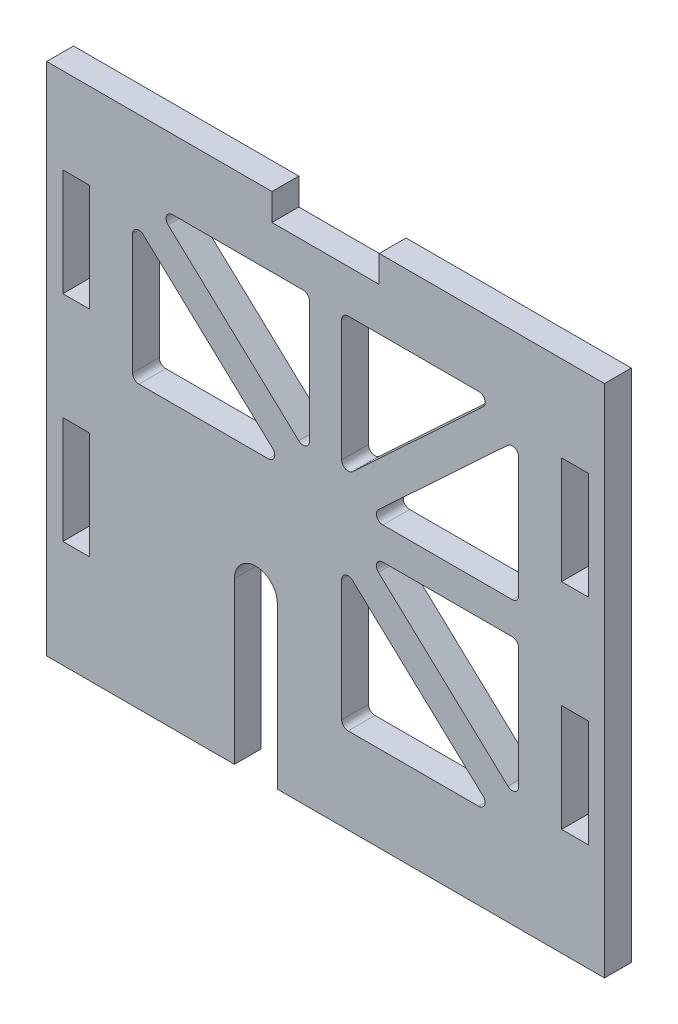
ISO-10303-21;
HEADER;
FILE_DESCRIPTION(('STEP AP214'),'2;1');
FILE_NAME('part.step','',(''),(''),'','','');
FILE_SCHEMA(('AUTOMOTIVE_DESIGN { 1 0 10303 214 1 1 1 1 }'));
ENDSEC;
DATA;
#1=APPLICATION_CONTEXT('core data for automotive mechanical design processes');
#2=APPLICATION_PROTOCOL_DEFINITION('international standard','automotive_design',2000,#1);
#3=PRODUCT_CONTEXT('',#1,'mechanical');
#4=PRODUCT('Part','Part','',(#3));
#5=PRODUCT_RELATED_PRODUCT_CATEGORY('part','',(#4));
#6=PRODUCT_DEFINITION_FORMATION('','',#4);
#7=PRODUCT_DEFINITION_CONTEXT('part definition',#1,'design');
#8=PRODUCT_DEFINITION('design','',#6,#7);
#9=PRODUCT_DEFINITION_SHAPE('','',#8);
#10=(LENGTH_UNIT() NAMED_UNIT(*) SI_UNIT(.MILLI.,.METRE.));
#11=(NAMED_UNIT(*) PLANE_ANGLE_UNIT() SI_UNIT($,.RADIAN.));
#12=(NAMED_UNIT(*) SI_UNIT($,.STERADIAN.) SOLID_ANGLE_UNIT());
#13=UNCERTAINTY_MEASURE_WITH_UNIT(LENGTH_MEASURE(1.E-05),#10,'distance_accuracy_value','');
#14=(GEOMETRIC_REPRESENTATION_CONTEXT(3) GLOBAL_UNCERTAINTY_ASSIGNED_CONTEXT((#13)) GLOBAL_UNIT_ASSIGNED_CONTEXT((#10,
#11,#12)) REPRESENTATION_CONTEXT('',''));
#15=CARTESIAN_POINT('',(0.,0.,0.));
#16=DIRECTION('',(0.,0.,1.));
#17=DIRECTION('',(1.,0.,0.));
#18=AXIS2_PLACEMENT_3D('',#15,#16,#17);
#19=CARTESIAN_POINT('',(0.,0.,2.5));
#20=DIRECTION('',(0.,0.,-1.));
#21=DIRECTION('',(-1.,0.,0.));
#22=AXIS2_PLACEMENT_3D('',#19,#20,#21);
#23=PLANE('',#22);
#24=CARTESIAN_POINT('',(17.4,38.0730838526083,2.5));
#25=DIRECTION('',(0.,0.,1.));
#26=DIRECTION('',(1.,0.,0.));
#27=AXIS2_PLACEMENT_3D('',#24,#25,#26);
#28=CIRCLE('',#27,0.600000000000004);
#29=CARTESIAN_POINT('',(16.9912615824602,38.5123251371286,2.5));
#30=VERTEX_POINT('',#29);
#31=CARTESIAN_POINT('',(18.,38.0730838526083,2.5));
#32=VERTEX_POINT('',#31);
#33=EDGE_CURVE('E166',#30,#32,#28,.F.);
#34=ORIENTED_EDGE('',*,*,#33,.T.);
#35=DIRECTION('',(0.,-1.,0.));
#36=VECTOR('',#35,1.);
#37=CARTESIAN_POINT('',(18.,0.,2.5));
#38=LINE('',#37,#36);
#39=CARTESIAN_POINT('',(18.,26.85,2.5));
#40=VERTEX_POINT('',#39);
#41=EDGE_CURVE('E583',#32,#40,#38,.T.);
#42=ORIENTED_EDGE('',*,*,#41,.T.);
#43=CARTESIAN_POINT('',(17.4,26.85,2.5));
#44=DIRECTION('',(0.,0.,1.));
#45=DIRECTION('',(1.,0.,0.));
#46=AXIS2_PLACEMENT_3D('',#43,#44,#45);
#47=CIRCLE('',#46,0.600000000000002);
#48=CARTESIAN_POINT('',(17.4,26.25,2.5));
#49=VERTEX_POINT('',#48);
#50=EDGE_CURVE('E596',#49,#40,#47,.T.);
#51=ORIENTED_EDGE('',*,*,#50,.F.);
#52=DIRECTION('',(-1.,0.,0.));
#53=VECTOR('',#52,1.);
#54=CARTESIAN_POINT('',(0.,26.25,2.5));
#55=LINE('',#54,#53);
#56=CARTESIAN_POINT('',(5.33937257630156,26.25,2.5));
#57=VERTEX_POINT('',#56);
#58=EDGE_CURVE('E599',#49,#57,#55,.T.);
#59=ORIENTED_EDGE('',*,*,#58,.T.);
#60=CARTESIAN_POINT('',(5.33937257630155,26.85,2.5));
#61=DIRECTION('',(0.,0.,1.));
#62=DIRECTION('',(1.,0.,0.));
#63=AXIS2_PLACEMENT_3D('',#60,#61,#62);
#64=CIRCLE('',#63,0.600000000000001);
#65=CARTESIAN_POINT('',(4.93063415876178,27.2892412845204,2.5));
#66=VERTEX_POINT('',#65);
#67=EDGE_CURVE('E602',#66,#57,#64,.T.);
#68=ORIENTED_EDGE('',*,*,#67,.F.);
#69=DIRECTION('',(0.732068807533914,0.681230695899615,0.));
#70=VECTOR('',#69,1.);
#71=CARTESIAN_POINT('',(-11.3211706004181,12.1660340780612,2.5));
#72=LINE('',#71,#70);
#73=EDGE_CURVE('E605',#66,#30,#72,.T.);
#74=ORIENTED_EDGE('',*,*,#73,.T.);
#75=EDGE_LOOP('',(#34,#42,#51,#59,#68,#74));
#76=FACE_BOUND('',#75,.T.);
#77=CARTESIAN_POINT('',(5.33937257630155,22.65,2.5));
#78=DIRECTION('',(0.,0.,1.));
#79=DIRECTION('',(1.,0.,0.));
#80=AXIS2_PLACEMENT_3D('',#77,#78,#79);
#81=CIRCLE('',#80,0.600000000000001);
#82=CARTESIAN_POINT('',(4.93063415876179,22.2107587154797,2.5));
#83=VERTEX_POINT('',#82);
#84=CARTESIAN_POINT('',(5.33937257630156,23.25,2.5));
#85=VERTEX_POINT('',#84);
#86=EDGE_CURVE('E651',#83,#85,#81,.F.);
#87=ORIENTED_EDGE('',*,*,#86,.T.);
#88=DIRECTION('',(-1.,0.,0.));
#89=VECTOR('',#88,1.);
#90=CARTESIAN_POINT('',(0.,23.25,2.5));
#91=LINE('',#90,#89);
#92=CARTESIAN_POINT('',(17.4,23.25,2.5));
#93=VERTEX_POINT('',#92);
#94=EDGE_CURVE('E672',#93,#85,#91,.T.);
#95=ORIENTED_EDGE('',*,*,#94,.F.);
#96=CARTESIAN_POINT('',(17.4,22.65,2.5));
#97=DIRECTION('',(0.,0.,1.));
#98=DIRECTION('',(1.,0.,0.));
#99=AXIS2_PLACEMENT_3D('',#96,#97,#98);
#100=CIRCLE('',#99,0.600000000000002);
#101=CARTESIAN_POINT('',(18.,22.65,2.5));
#102=VERTEX_POINT('',#101);
#103=EDGE_CURVE('E682',#93,#102,#100,.F.);
#104=ORIENTED_EDGE('',*,*,#103,.T.);
#105=DIRECTION('',(0.,1.,0.));
#106=VECTOR('',#105,1.);
#107=CARTESIAN_POINT('',(18.,0.,2.5));
#108=LINE('',#107,#106);
#109=CARTESIAN_POINT('',(18.,11.4269161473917,2.5));
#110=VERTEX_POINT('',#109);
#111=EDGE_CURVE('E685',#110,#102,#108,.T.);
#112=ORIENTED_EDGE('',*,*,#111,.F.);
#113=CARTESIAN_POINT('',(17.4,11.4269161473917,2.5));
#114=DIRECTION('',(0.,0.,1.));
#115=DIRECTION('',(1.,0.,0.));
#116=AXIS2_PLACEMENT_3D('',#113,#114,#115);
#117=CIRCLE('',#116,0.600000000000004);
#118=CARTESIAN_POINT('',(16.9912615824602,10.9876748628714,2.5));
#119=VERTEX_POINT('',#118);
#120=EDGE_CURVE('E688',#119,#110,#117,.T.);
#121=ORIENTED_EDGE('',*,*,#120,.F.);
#122=DIRECTION('',(0.732068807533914,-0.681230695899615,0.));
#123=VECTOR('',#122,1.);
#124=CARTESIAN_POINT('',(13.364862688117,14.362240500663,2.5));
#125=LINE('',#124,#123);
#126=EDGE_CURVE('E691',#83,#119,#125,.T.);
#127=ORIENTED_EDGE('',*,*,#126,.F.);
#128=EDGE_LOOP('',(#87,#95,#104,#112,#121,#127));
#129=FACE_BOUND('',#128,.T.);
#130=CARTESIAN_POINT('',(14.2725677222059,40.9,2.5));
#131=DIRECTION('',(0.,0.,1.));
#132=DIRECTION('',(1.,0.,0.));
#133=AXIS2_PLACEMENT_3D('',#130,#131,#132);
#134=CIRCLE('',#133,0.600000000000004);
#135=CARTESIAN_POINT('',(14.6813061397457,40.4607587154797,2.5));
#136=VERTEX_POINT('',#135);
#137=CARTESIAN_POINT('',(14.2725677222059,41.5,2.5));
#138=VERTEX_POINT('',#137);
#139=EDGE_CURVE('E663',#136,#138,#134,.T.);
#140=ORIENTED_EDGE('',*,*,#139,.F.);
#141=DIRECTION('',(0.732068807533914,0.681230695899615,0.));
#142=VECTOR('',#141,1.);
#143=CARTESIAN_POINT('',(-13.364862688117,14.362240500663,2.5));
#144=LINE('',#143,#142);
#145=CARTESIAN_POINT('',(2.50873841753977,29.1335081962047,2.5));
#146=VERTEX_POINT('',#145);
#147=EDGE_CURVE('E666',#146,#136,#144,.T.);
#148=ORIENTED_EDGE('',*,*,#147,.F.);
#149=CARTESIAN_POINT('',(2.1,29.572749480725,2.5));
#150=DIRECTION('',(0.,0.,1.));
#151=DIRECTION('',(1.,0.,0.));
#152=AXIS2_PLACEMENT_3D('',#149,#150,#151);
#153=CIRCLE('',#152,0.600000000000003);
#154=CARTESIAN_POINT('',(1.5,29.572749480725,2.5));
#155=VERTEX_POINT('',#154);
#156=EDGE_CURVE('E640',#155,#146,#153,.T.);
#157=ORIENTED_EDGE('',*,*,#156,.F.);
#158=DIRECTION('',(0.,-1.,0.));
#159=VECTOR('',#158,1.);
#160=CARTESIAN_POINT('',(1.5,0.,2.5));
#161=LINE('',#160,#159);
#162=CARTESIAN_POINT('',(1.5,40.9,2.5));
#163=VERTEX_POINT('',#162);
#164=EDGE_CURVE('E654',#163,#155,#161,.T.);
#165=ORIENTED_EDGE('',*,*,#164,.F.);
#166=CARTESIAN_POINT('',(2.1,40.9,2.5));
#167=DIRECTION('',(0.,0.,1.));
#168=DIRECTION('',(1.,0.,0.));
#169=AXIS2_PLACEMENT_3D('',#166,#167,#168);
#170=CIRCLE('',#169,0.599999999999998);
#171=CARTESIAN_POINT('',(2.1,41.5,2.5));
#172=VERTEX_POINT('',#171);
#173=EDGE_CURVE('E657',#172,#163,#170,.T.);
#174=ORIENTED_EDGE('',*,*,#173,.F.);
#175=DIRECTION('',(-1.,0.,0.));
#176=VECTOR('',#175,1.);
#177=CARTESIAN_POINT('',(0.,41.5,2.5));
#178=LINE('',#177,#176);
#179=EDGE_CURVE('E660',#138,#172,#178,.T.);
#180=ORIENTED_EDGE('',*,*,#179,.F.);
#181=EDGE_LOOP('',(#140,#148,#157,#165,#174,#180));
#182=FACE_BOUND('',#181,.T.);
#183=DIRECTION('',(0.,1.,0.));
#184=VECTOR('',#183,1.);
#185=CARTESIAN_POINT('',(24.5,40.,2.5));
#186=LINE('',#185,#184);
#187=CARTESIAN_POINT('',(24.5,30.,2.5));
#188=VERTEX_POINT('',#187);
#189=CARTESIAN_POINT('',(24.5,40.,2.5));
#190=VERTEX_POINT('',#189);
#191=EDGE_CURVE('E875',#188,#190,#186,.T.);
#192=ORIENTED_EDGE('',*,*,#191,.F.);
#193=DIRECTION('',(1.,0.,0.));
#194=VECTOR('',#193,1.);
#195=CARTESIAN_POINT('',(22.,30.,2.5));
#196=LINE('',#195,#194);
#197=CARTESIAN_POINT('',(22.,30.,2.5));
#198=VERTEX_POINT('',#197);
#199=EDGE_CURVE('E878',#198,#188,#196,.T.);
#200=ORIENTED_EDGE('',*,*,#199,.F.);
#201=DIRECTION('',(0.,-1.,0.));
#202=VECTOR('',#201,1.);
#203=CARTESIAN_POINT('',(22.,40.,2.5));
#204=LINE('',#203,#202);
#205=CARTESIAN_POINT('',(22.,40.,2.5));
#206=VERTEX_POINT('',#205);
#207=EDGE_CURVE('E809',#206,#198,#204,.T.);
#208=ORIENTED_EDGE('',*,*,#207,.F.);
#209=DIRECTION('',(-1.,0.,0.));
#210=VECTOR('',#209,1.);
#211=CARTESIAN_POINT('',(22.,40.,2.5));
#212=LINE('',#211,#210);
#213=EDGE_CURVE('E872',#190,#206,#212,.T.);
#214=ORIENTED_EDGE('',*,*,#213,.F.);
#215=EDGE_LOOP('',(#192,#200,#208,#214));
#216=FACE_BOUND('',#215,.T.);
#217=DIRECTION('',(1.,0.,0.));
#218=VECTOR('',#217,1.);
#219=CARTESIAN_POINT('',(-22.,30.,2.5));
#220=LINE('',#219,#218);
#221=CARTESIAN_POINT('',(-24.5,30.,2.5));
#222=VERTEX_POINT('',#221);
#223=CARTESIAN_POINT('',(-22.,30.,2.5));
#224=VERTEX_POINT('',#223);
#225=EDGE_CURVE('E845',#222,#224,#220,.T.);
#226=ORIENTED_EDGE('',*,*,#225,.F.);
#227=DIRECTION('',(0.,-1.,0.));
#228=VECTOR('',#227,1.);
#229=CARTESIAN_POINT('',(-24.5,40.,2.5));
#230=LINE('',#229,#228);
#231=CARTESIAN_POINT('',(-24.5,40.,2.5));
#232=VERTEX_POINT('',#231);
#233=EDGE_CURVE('E848',#232,#222,#230,.T.);
#234=ORIENTED_EDGE('',*,*,#233,.F.);
#235=DIRECTION('',(-1.,0.,0.));
#236=VECTOR('',#235,1.);
#237=CARTESIAN_POINT('',(-22.,40.,2.5));
#238=LINE('',#237,#236);
#239=CARTESIAN_POINT('',(-22.,40.,2.5));
#240=VERTEX_POINT('',#239);
#241=EDGE_CURVE('E775',#240,#232,#238,.T.);
#242=ORIENTED_EDGE('',*,*,#241,.F.);
#243=DIRECTION('',(0.,1.,0.));
#244=VECTOR('',#243,1.);
#245=CARTESIAN_POINT('',(-22.,40.,2.5));
#246=LINE('',#245,#244);
#247=EDGE_CURVE('E842',#224,#240,#246,.T.);
#248=ORIENTED_EDGE('',*,*,#247,.F.);
#249=EDGE_LOOP('',(#226,#234,#242,#248));
#250=FACE_BOUND('',#249,.T.);
#251=DIRECTION('',(1.,0.,0.));
#252=VECTOR('',#251,1.);
#253=CARTESIAN_POINT('',(-22.,10.,2.5));
#254=LINE('',#253,#252);
#255=CARTESIAN_POINT('',(-24.5,10.,2.5));
#256=VERTEX_POINT('',#255);
#257=CARTESIAN_POINT('',(-22.,10.,2.5));
#258=VERTEX_POINT('',#257);
#259=EDGE_CURVE('E813',#256,#258,#254,.T.);
#260=ORIENTED_EDGE('',*,*,#259,.F.);
#261=DIRECTION('',(0.,-1.,0.));
#262=VECTOR('',#261,1.);
#263=CARTESIAN_POINT('',(-24.5,20.,2.5));
#264=LINE('',#263,#262);
#265=CARTESIAN_POINT('',(-24.5,20.,2.5));
#266=VERTEX_POINT('',#265);
#267=EDGE_CURVE('E816',#266,#256,#264,.T.);
#268=ORIENTED_EDGE('',*,*,#267,.F.);
#269=DIRECTION('',(-1.,0.,0.));
#270=VECTOR('',#269,1.);
#271=CARTESIAN_POINT('',(-22.,20.,2.5));
#272=LINE('',#271,#270);
#273=CARTESIAN_POINT('',(-22.,20.,2.5));
#274=VERTEX_POINT('',#273);
#275=EDGE_CURVE('E819',#274,#266,#272,.T.);
#276=ORIENTED_EDGE('',*,*,#275,.F.);
#277=DIRECTION('',(0.,1.,0.));
#278=VECTOR('',#277,1.);
#279=CARTESIAN_POINT('',(-22.,20.,2.5));
#280=LINE('',#279,#278);
#281=EDGE_CURVE('E810',#258,#274,#280,.T.);
#282=ORIENTED_EDGE('',*,*,#281,.F.);
#283=EDGE_LOOP('',(#260,#268,#276,#282));
#284=FACE_BOUND('',#283,.T.);
#285=DIRECTION('',(0.,1.,0.));
#286=VECTOR('',#285,1.);
#287=CARTESIAN_POINT('',(24.5,20.,2.5));
#288=LINE('',#287,#286);
#289=CARTESIAN_POINT('',(24.5,10.,2.5));
#290=VERTEX_POINT('',#289);
#291=CARTESIAN_POINT('',(24.5,20.,2.5));
#292=VERTEX_POINT('',#291);
#293=EDGE_CURVE('E779',#290,#292,#288,.T.);
#294=ORIENTED_EDGE('',*,*,#293,.F.);
#295=DIRECTION('',(1.,0.,0.));
#296=VECTOR('',#295,1.);
#297=CARTESIAN_POINT('',(22.,10.,2.5));
#298=LINE('',#297,#296);
#299=CARTESIAN_POINT('',(22.,10.,2.5));
#300=VERTEX_POINT('',#299);
#301=EDGE_CURVE('E782',#300,#290,#298,.T.);
#302=ORIENTED_EDGE('',*,*,#301,.F.);
#303=DIRECTION('',(0.,-1.,0.));
#304=VECTOR('',#303,1.);
#305=CARTESIAN_POINT('',(22.,20.,2.5));
#306=LINE('',#305,#304);
#307=CARTESIAN_POINT('',(22.,20.,2.5));
#308=VERTEX_POINT('',#307);
#309=EDGE_CURVE('E785',#308,#300,#306,.T.);
#310=ORIENTED_EDGE('',*,*,#309,.F.);
#311=DIRECTION('',(-1.,0.,0.));
#312=VECTOR('',#311,1.);
#313=CARTESIAN_POINT('',(22.,20.,2.5));
#314=LINE('',#313,#312);
#315=EDGE_CURVE('E776',#292,#308,#314,.T.);
#316=ORIENTED_EDGE('',*,*,#315,.F.);
#317=EDGE_LOOP('',(#294,#302,#310,#316));
#318=FACE_BOUND('',#317,.T.);
#319=DIRECTION('',(-1.,0.,0.));
#320=VECTOR('',#319,1.);
#321=CARTESIAN_POINT('',(-26.,48.,2.5));
#322=LINE('',#321,#320);
#323=CARTESIAN_POINT('',(26.,48.,2.5));
#324=VERTEX_POINT('',#323);
#325=CARTESIAN_POINT('',(5.,48.,2.5));
#326=VERTEX_POINT('',#325);
#327=EDGE_CURVE('E915',#324,#326,#322,.T.);
#328=ORIENTED_EDGE('',*,*,#327,.T.);
#329=DIRECTION('',(0.,1.,0.));
#330=VECTOR('',#329,1.);
#331=CARTESIAN_POINT('',(5.,48.,2.5));
#332=LINE('',#331,#330);
#333=CARTESIAN_POINT('',(5.,45.5,2.5));
#334=VERTEX_POINT('',#333);
#335=EDGE_CURVE('E727',#334,#326,#332,.T.);
#336=ORIENTED_EDGE('',*,*,#335,.F.);
#337=DIRECTION('',(1.,0.,0.));
#338=VECTOR('',#337,1.);
#339=CARTESIAN_POINT('',(-5.,45.5,2.5));
#340=LINE('',#339,#338);
#341=CARTESIAN_POINT('',(-5.,45.5,2.5));
#342=VERTEX_POINT('',#341);
#343=EDGE_CURVE('E730',#342,#334,#340,.T.);
#344=ORIENTED_EDGE('',*,*,#343,.F.);
#345=DIRECTION('',(0.,-1.,0.));
#346=VECTOR('',#345,1.);
#347=CARTESIAN_POINT('',(-5.,48.,2.5));
#348=LINE('',#347,#346);
#349=CARTESIAN_POINT('',(-5.,48.,2.5));
#350=VERTEX_POINT('',#349);
#351=EDGE_CURVE('E716',#350,#342,#348,.T.);
#352=ORIENTED_EDGE('',*,*,#351,.F.);
#353=CARTESIAN_POINT('',(-26.,48.,2.5));
#354=VERTEX_POINT('',#353);
#355=EDGE_CURVE('E914',#350,#354,#322,.T.);
#356=ORIENTED_EDGE('',*,*,#355,.T.);
#357=DIRECTION('',(0.,-1.,0.));
#358=VECTOR('',#357,1.);
#359=CARTESIAN_POINT('',(-26.,0.,2.5));
#360=LINE('',#359,#358);
#361=CARTESIAN_POINT('',(-26.,0.,2.5));
#362=VERTEX_POINT('',#361);
#363=EDGE_CURVE('E904',#354,#362,#360,.T.);
#364=ORIENTED_EDGE('',*,*,#363,.T.);
#365=DIRECTION('',(1.,0.,0.));
#366=VECTOR('',#365,1.);
#367=CARTESIAN_POINT('',(-26.,0.,2.5));
#368=LINE('',#367,#366);
#369=CARTESIAN_POINT('',(-8.5,0.,2.5));
#370=VERTEX_POINT('',#369);
#371=EDGE_CURVE('E909',#362,#370,#368,.T.);
#372=ORIENTED_EDGE('',*,*,#371,.T.);
#373=DIRECTION('',(0.,-1.,0.));
#374=VECTOR('',#373,1.);
#375=CARTESIAN_POINT('',(-8.5,0.,2.5));
#376=LINE('',#375,#374);
#377=CARTESIAN_POINT('',(-8.5,15.,2.5));
#378=VERTEX_POINT('',#377);
#379=EDGE_CURVE('E755',#378,#370,#376,.T.);
#380=ORIENTED_EDGE('',*,*,#379,.F.);
#381=CARTESIAN_POINT('',(-6.5,15.,2.5));
#382=DIRECTION('',(0.,0.,-1.));
#383=DIRECTION('',(-1.,0.,0.));
#384=AXIS2_PLACEMENT_3D('',#381,#382,#383);
#385=CIRCLE('',#384,2.);
#386=CARTESIAN_POINT('',(-4.5,15.,2.5));
#387=VERTEX_POINT('',#386);
#388=EDGE_CURVE('E758',#387,#378,#385,.F.);
#389=ORIENTED_EDGE('',*,*,#388,.F.);
#390=DIRECTION('',(0.,1.,0.));
#391=VECTOR('',#390,1.);
#392=CARTESIAN_POINT('',(-4.5,0.,2.5));
#393=LINE('',#392,#391);
#394=CARTESIAN_POINT('',(-4.5,0.,2.5));
#395=VERTEX_POINT('',#394);
#396=EDGE_CURVE('E753',#395,#387,#393,.T.);
#397=ORIENTED_EDGE('',*,*,#396,.F.);
#398=CARTESIAN_POINT('',(26.,0.,2.5));
#399=VERTEX_POINT('',#398);
#400=EDGE_CURVE('E907',#395,#399,#368,.T.);
#401=ORIENTED_EDGE('',*,*,#400,.T.);
#402=DIRECTION('',(0.,1.,0.));
#403=VECTOR('',#402,1.);
#404=CARTESIAN_POINT('',(26.,0.,2.5));
#405=LINE('',#404,#403);
#406=EDGE_CURVE('E912',#399,#324,#405,.T.);
#407=ORIENTED_EDGE('',*,*,#406,.T.);
#408=EDGE_LOOP('',(#328,#336,#344,#352,#356,#364,#372,#380,#389,#397,#401,#407));
#409=FACE_BOUND('',#408,.T.);
#410=CARTESIAN_POINT('',(-2.1,40.9,2.5));
#411=DIRECTION('',(0.,0.,1.));
#412=DIRECTION('',(1.,0.,0.));
#413=AXIS2_PLACEMENT_3D('',#410,#411,#412);
#414=CIRCLE('',#413,0.599999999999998);
#415=CARTESIAN_POINT('',(-2.1,41.5,2.5));
#416=VERTEX_POINT('',#415);
#417=CARTESIAN_POINT('',(-1.5,40.9,2.5));
#418=VERTEX_POINT('',#417);
#419=EDGE_CURVE('E668',#416,#418,#414,.F.);
#420=ORIENTED_EDGE('',*,*,#419,.T.);
#421=DIRECTION('',(0.,-1.,0.));
#422=VECTOR('',#421,1.);
#423=CARTESIAN_POINT('',(-1.5,0.,2.5));
#424=LINE('',#423,#422);
#425=CARTESIAN_POINT('',(-1.5,29.572749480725,2.5));
#426=VERTEX_POINT('',#425);
#427=EDGE_CURVE('E710',#418,#426,#424,.T.);
#428=ORIENTED_EDGE('',*,*,#427,.T.);
#429=CARTESIAN_POINT('',(-2.1,29.572749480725,2.5));
#430=DIRECTION('',(0.,0.,1.));
#431=DIRECTION('',(1.,0.,0.));
#432=AXIS2_PLACEMENT_3D('',#429,#430,#431);
#433=CIRCLE('',#432,0.600000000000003);
#434=CARTESIAN_POINT('',(-2.50873841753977,29.1335081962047,2.5));
#435=VERTEX_POINT('',#434);
#436=EDGE_CURVE('E707',#426,#435,#433,.F.);
#437=ORIENTED_EDGE('',*,*,#436,.T.);
#438=DIRECTION('',(-0.732068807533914,0.681230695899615,0.));
#439=VECTOR('',#438,1.);
#440=CARTESIAN_POINT('',(13.364862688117,14.362240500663,2.5));
#441=LINE('',#440,#439);
#442=CARTESIAN_POINT('',(-14.6813061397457,40.4607587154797,2.5));
#443=VERTEX_POINT('',#442);
#444=EDGE_CURVE('E704',#435,#443,#441,.T.);
#445=ORIENTED_EDGE('',*,*,#444,.T.);
#446=CARTESIAN_POINT('',(-14.2725677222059,40.9,2.5));
#447=DIRECTION('',(0.,0.,1.));
#448=DIRECTION('',(1.,0.,0.));
#449=AXIS2_PLACEMENT_3D('',#446,#447,#448);
#450=CIRCLE('',#449,0.600000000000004);
#451=CARTESIAN_POINT('',(-14.2725677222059,41.5,2.5));
#452=VERTEX_POINT('',#451);
#453=EDGE_CURVE('E701',#443,#452,#450,.F.);
#454=ORIENTED_EDGE('',*,*,#453,.T.);
#455=DIRECTION('',(1.,0.,0.));
#456=VECTOR('',#455,1.);
#457=CARTESIAN_POINT('',(0.,41.5,2.5));
#458=LINE('',#457,#456);
#459=EDGE_CURVE('E698',#452,#416,#458,.T.);
#460=ORIENTED_EDGE('',*,*,#459,.T.);
#461=EDGE_LOOP('',(#420,#428,#437,#445,#454,#460));
#462=FACE_BOUND('',#461,.T.);
#463=CARTESIAN_POINT('',(2.1,8.6,2.5));
#464=DIRECTION('',(0.,0.,1.));
#465=DIRECTION('',(1.,0.,0.));
#466=AXIS2_PLACEMENT_3D('',#463,#464,#465);
#467=CIRCLE('',#466,0.599999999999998);
#468=CARTESIAN_POINT('',(2.1,8.00000000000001,2.5));
#469=VERTEX_POINT('',#468);
#470=CARTESIAN_POINT('',(1.5,8.6,2.5));
#471=VERTEX_POINT('',#470);
#472=EDGE_CURVE('E550',#469,#471,#467,.F.);
#473=ORIENTED_EDGE('',*,*,#472,.T.);
#474=DIRECTION('',(0.,1.,0.));
#475=VECTOR('',#474,1.);
#476=CARTESIAN_POINT('',(1.5,0.,2.5));
#477=LINE('',#476,#475);
#478=CARTESIAN_POINT('',(1.5,19.927250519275,2.5));
#479=VERTEX_POINT('',#478);
#480=EDGE_CURVE('E559',#471,#479,#477,.T.);
#481=ORIENTED_EDGE('',*,*,#480,.T.);
#482=CARTESIAN_POINT('',(2.1,19.927250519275,2.5));
#483=DIRECTION('',(0.,0.,1.));
#484=DIRECTION('',(1.,0.,0.));
#485=AXIS2_PLACEMENT_3D('',#482,#483,#484);
#486=CIRCLE('',#485,0.600000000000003);
#487=CARTESIAN_POINT('',(2.50873841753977,20.3664918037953,2.5));
#488=VERTEX_POINT('',#487);
#489=EDGE_CURVE('E565',#479,#488,#486,.F.);
#490=ORIENTED_EDGE('',*,*,#489,.T.);
#491=DIRECTION('',(0.732068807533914,-0.681230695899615,0.));
#492=VECTOR('',#491,1.);
#493=CARTESIAN_POINT('',(11.3211706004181,12.1660340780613,2.5));
#494=LINE('',#493,#492);
#495=CARTESIAN_POINT('',(14.6813061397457,9.03924128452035,2.5));
#496=VERTEX_POINT('',#495);
#497=EDGE_CURVE('E1751',#488,#496,#494,.T.);
#498=ORIENTED_EDGE('',*,*,#497,.T.);
#499=CARTESIAN_POINT('',(14.2725677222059,8.6,2.5));
#500=DIRECTION('',(0.,0.,1.));
#501=DIRECTION('',(1.,0.,0.));
#502=AXIS2_PLACEMENT_3D('',#499,#500,#501);
#503=CIRCLE('',#502,0.600000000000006);
#504=CARTESIAN_POINT('',(14.2725677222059,7.99999999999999,2.5));
#505=VERTEX_POINT('',#504);
#506=EDGE_CURVE('E577',#496,#505,#503,.F.);
#507=ORIENTED_EDGE('',*,*,#506,.T.);
#508=DIRECTION('',(-1.,0.,0.));
#509=VECTOR('',#508,1.);
#510=CARTESIAN_POINT('',(0.,8.00000000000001,2.5));
#511=LINE('',#510,#509);
#512=EDGE_CURVE('E572',#505,#469,#511,.T.);
#513=ORIENTED_EDGE('',*,*,#512,.T.);
#514=EDGE_LOOP('',(#473,#481,#490,#498,#507,#513));
#515=FACE_BOUND('',#514,.T.);
#516=CARTESIAN_POINT('',(-5.33937257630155,26.85,2.5));
#517=DIRECTION('',(0.,0.,-1.));
#518=DIRECTION('',(-1.,0.,0.));
#519=AXIS2_PLACEMENT_3D('',#516,#517,#518);
#520=CIRCLE('',#519,0.600000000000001);
#521=CARTESIAN_POINT('',(-4.93063415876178,27.2892412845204,2.5));
#522=VERTEX_POINT('',#521);
#523=CARTESIAN_POINT('',(-5.33937257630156,26.25,2.5));
#524=VERTEX_POINT('',#523);
#525=EDGE_CURVE('E158',#522,#524,#520,.T.);
#526=ORIENTED_EDGE('',*,*,#525,.T.);
#527=DIRECTION('',(1.,0.,0.));
#528=VECTOR('',#527,1.);
#529=CARTESIAN_POINT('',(-17.4,26.25,2.5));
#530=LINE('',#529,#528);
#531=CARTESIAN_POINT('',(-17.4,26.25,2.5));
#532=VERTEX_POINT('',#531);
#533=EDGE_CURVE('E633',#532,#524,#530,.T.);
#534=ORIENTED_EDGE('',*,*,#533,.F.);
#535=CARTESIAN_POINT('',(-17.4,26.85,2.5));
#536=DIRECTION('',(0.,0.,-1.));
#537=DIRECTION('',(-1.,0.,0.));
#538=AXIS2_PLACEMENT_3D('',#535,#536,#537);
#539=CIRCLE('',#538,0.600000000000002);
#540=CARTESIAN_POINT('',(-18.,26.85,2.5));
#541=VERTEX_POINT('',#540);
#542=EDGE_CURVE('E630',#532,#541,#539,.T.);
#543=ORIENTED_EDGE('',*,*,#542,.T.);
#544=DIRECTION('',(0.,-1.,0.));
#545=VECTOR('',#544,1.);
#546=CARTESIAN_POINT('',(-18.,38.0730838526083,2.5));
#547=LINE('',#546,#545);
#548=CARTESIAN_POINT('',(-18.,38.0730838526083,2.5));
#549=VERTEX_POINT('',#548);
#550=EDGE_CURVE('E627',#549,#541,#547,.T.);
#551=ORIENTED_EDGE('',*,*,#550,.F.);
#552=CARTESIAN_POINT('',(-17.4,38.0730838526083,2.5));
#553=DIRECTION('',(0.,0.,1.));
#554=DIRECTION('',(1.,0.,0.));
#555=AXIS2_PLACEMENT_3D('',#552,#553,#554);
#556=CIRCLE('',#555,0.600000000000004);
#557=CARTESIAN_POINT('',(-16.9912615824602,38.5123251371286,2.5));
#558=VERTEX_POINT('',#557);
#559=EDGE_CURVE('E624',#558,#549,#556,.T.);
#560=ORIENTED_EDGE('',*,*,#559,.F.);
#561=DIRECTION('',(-0.732068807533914,0.681230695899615,0.));
#562=VECTOR('',#561,1.);
#563=CARTESIAN_POINT('',(-4.93063415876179,27.2892412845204,2.5));
#564=LINE('',#563,#562);
#565=EDGE_CURVE('E621',#522,#558,#564,.T.);
#566=ORIENTED_EDGE('',*,*,#565,.F.);
#567=EDGE_LOOP('',(#526,#534,#543,#551,#560,#566));
#568=FACE_BOUND('',#567,.T.);
#569=ADVANCED_FACE('F143',(#76,#129,#182,#216,#250,#284,#318,#409,#462,#515,#568),#23,.F.);
#570=CARTESIAN_POINT('',(0.,0.,0.));
#571=DIRECTION('',(0.,0.,-1.));
#572=DIRECTION('',(-1.,0.,0.));
#573=AXIS2_PLACEMENT_3D('',#570,#571,#572);
#574=PLANE('',#573);
#575=DIRECTION('',(-0.732068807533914,-0.681230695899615,0.));
#576=VECTOR('',#575,1.);
#577=CARTESIAN_POINT('',(-13.364862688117,14.362240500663,0.));
#578=LINE('',#577,#576);
#579=CARTESIAN_POINT('',(14.6813061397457,40.4607587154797,0.));
#580=VERTEX_POINT('',#579);
#581=CARTESIAN_POINT('',(2.50873841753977,29.1335081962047,0.));
#582=VERTEX_POINT('',#581);
#583=EDGE_CURVE('E970',#580,#582,#578,.T.);
#584=ORIENTED_EDGE('',*,*,#583,.F.);
#585=CARTESIAN_POINT('',(14.2725677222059,40.9,0.));
#586=DIRECTION('',(0.,0.,-1.));
#587=DIRECTION('',(-1.,0.,0.));
#588=AXIS2_PLACEMENT_3D('',#585,#586,#587);
#589=CIRCLE('',#588,0.600000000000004);
#590=CARTESIAN_POINT('',(14.2725677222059,41.5,0.));
#591=VERTEX_POINT('',#590);
#592=EDGE_CURVE('E959',#591,#580,#589,.T.);
#593=ORIENTED_EDGE('',*,*,#592,.F.);
#594=DIRECTION('',(1.,0.,0.));
#595=VECTOR('',#594,1.);
#596=CARTESIAN_POINT('',(0.,41.5,0.));
#597=LINE('',#596,#595);
#598=CARTESIAN_POINT('',(2.1,41.5,0.));
#599=VERTEX_POINT('',#598);
#600=EDGE_CURVE('E961',#599,#591,#597,.T.);
#601=ORIENTED_EDGE('',*,*,#600,.F.);
#602=CARTESIAN_POINT('',(2.1,40.9,0.));
#603=DIRECTION('',(0.,0.,-1.));
#604=DIRECTION('',(-1.,0.,0.));
#605=AXIS2_PLACEMENT_3D('',#602,#603,#604);
#606=CIRCLE('',#605,0.599999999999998);
#607=CARTESIAN_POINT('',(1.5,40.9,0.));
#608=VERTEX_POINT('',#607);
#609=EDGE_CURVE('E964',#608,#599,#606,.T.);
#610=ORIENTED_EDGE('',*,*,#609,.F.);
#611=DIRECTION('',(0.,1.,0.));
#612=VECTOR('',#611,1.);
#613=CARTESIAN_POINT('',(1.5,0.,0.));
#614=LINE('',#613,#612);
#615=CARTESIAN_POINT('',(1.5,29.572749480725,0.));
#616=VERTEX_POINT('',#615);
#617=EDGE_CURVE('E966',#616,#608,#614,.T.);
#618=ORIENTED_EDGE('',*,*,#617,.F.);
#619=CARTESIAN_POINT('',(2.1,29.572749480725,0.));
#620=DIRECTION('',(0.,0.,-1.));
#621=DIRECTION('',(-1.,0.,0.));
#622=AXIS2_PLACEMENT_3D('',#619,#620,#621);
#623=CIRCLE('',#622,0.600000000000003);
#624=EDGE_CURVE('E968',#582,#616,#623,.T.);
#625=ORIENTED_EDGE('',*,*,#624,.F.);
#626=EDGE_LOOP('',(#584,#593,#601,#610,#618,#625));
#627=FACE_BOUND('',#626,.T.);
#628=DIRECTION('',(0.,1.,0.));
#629=VECTOR('',#628,1.);
#630=CARTESIAN_POINT('',(5.,48.,0.));
#631=LINE('',#630,#629);
#632=CARTESIAN_POINT('',(5.,45.5,0.));
#633=VERTEX_POINT('',#632);
#634=CARTESIAN_POINT('',(5.,48.,0.));
#635=VERTEX_POINT('',#634);
#636=EDGE_CURVE('E743',#633,#635,#631,.T.);
#637=ORIENTED_EDGE('',*,*,#636,.T.);
#638=DIRECTION('',(-1.,0.,0.));
#639=VECTOR('',#638,1.);
#640=CARTESIAN_POINT('',(-26.,48.,0.));
#641=LINE('',#640,#639);
#642=CARTESIAN_POINT('',(26.,48.,0.));
#643=VERTEX_POINT('',#642);
#644=EDGE_CURVE('E908',#643,#635,#641,.T.);
#645=ORIENTED_EDGE('',*,*,#644,.F.);
#646=DIRECTION('',(0.,1.,0.));
#647=VECTOR('',#646,1.);
#648=CARTESIAN_POINT('',(26.,0.,0.));
#649=LINE('',#648,#647);
#650=CARTESIAN_POINT('',(26.,0.,0.));
#651=VERTEX_POINT('',#650);
#652=EDGE_CURVE('E925',#651,#643,#649,.T.);
#653=ORIENTED_EDGE('',*,*,#652,.F.);
#654=DIRECTION('',(1.,0.,0.));
#655=VECTOR('',#654,1.);
#656=CARTESIAN_POINT('',(-26.,0.,0.));
#657=LINE('',#656,#655);
#658=CARTESIAN_POINT('',(-4.5,0.,0.));
#659=VERTEX_POINT('',#658);
#660=EDGE_CURVE('E921',#659,#651,#657,.T.);
#661=ORIENTED_EDGE('',*,*,#660,.F.);
#662=DIRECTION('',(0.,-1.,0.));
#663=VECTOR('',#662,1.);
#664=CARTESIAN_POINT('',(-4.5,0.,0.));
#665=LINE('',#664,#663);
#666=CARTESIAN_POINT('',(-4.5,15.,0.));
#667=VERTEX_POINT('',#666);
#668=EDGE_CURVE('E763',#667,#659,#665,.T.);
#669=ORIENTED_EDGE('',*,*,#668,.F.);
#670=CARTESIAN_POINT('',(-6.5,15.,0.));
#671=DIRECTION('',(0.,0.,-1.));
#672=DIRECTION('',(-1.,0.,0.));
#673=AXIS2_PLACEMENT_3D('',#670,#671,#672);
#674=CIRCLE('',#673,2.);
#675=CARTESIAN_POINT('',(-8.5,15.,0.));
#676=VERTEX_POINT('',#675);
#677=EDGE_CURVE('E760',#676,#667,#674,.T.);
#678=ORIENTED_EDGE('',*,*,#677,.F.);
#679=DIRECTION('',(0.,1.,0.));
#680=VECTOR('',#679,1.);
#681=CARTESIAN_POINT('',(-8.5,0.,0.));
#682=LINE('',#681,#680);
#683=CARTESIAN_POINT('',(-8.5,0.,0.));
#684=VERTEX_POINT('',#683);
#685=EDGE_CURVE('E752',#684,#676,#682,.T.);
#686=ORIENTED_EDGE('',*,*,#685,.F.);
#687=CARTESIAN_POINT('',(-26.,0.,0.));
#688=VERTEX_POINT('',#687);
#689=EDGE_CURVE('E922',#688,#684,#657,.T.);
#690=ORIENTED_EDGE('',*,*,#689,.F.);
#691=DIRECTION('',(0.,-1.,0.));
#692=VECTOR('',#691,1.);
#693=CARTESIAN_POINT('',(-26.,0.,0.));
#694=LINE('',#693,#692);
#695=CARTESIAN_POINT('',(-26.,48.,0.));
#696=VERTEX_POINT('',#695);
#697=EDGE_CURVE('E903',#696,#688,#694,.T.);
#698=ORIENTED_EDGE('',*,*,#697,.F.);
#699=CARTESIAN_POINT('',(-5.,48.,0.));
#700=VERTEX_POINT('',#699);
#701=EDGE_CURVE('E927',#700,#696,#641,.T.);
#702=ORIENTED_EDGE('',*,*,#701,.F.);
#703=DIRECTION('',(0.,-1.,0.));
#704=VECTOR('',#703,1.);
#705=CARTESIAN_POINT('',(-5.,48.,0.));
#706=LINE('',#705,#704);
#707=CARTESIAN_POINT('',(-5.,45.5,0.));
#708=VERTEX_POINT('',#707);
#709=EDGE_CURVE('E738',#700,#708,#706,.T.);
#710=ORIENTED_EDGE('',*,*,#709,.T.);
#711=DIRECTION('',(1.,0.,0.));
#712=VECTOR('',#711,1.);
#713=CARTESIAN_POINT('',(-5.,45.5,0.));
#714=LINE('',#713,#712);
#715=EDGE_CURVE('E729',#708,#633,#714,.T.);
#716=ORIENTED_EDGE('',*,*,#715,.T.);
#717=EDGE_LOOP('',(#637,#645,#653,#661,#669,#678,#686,#690,#698,#702,#710,#716));
#718=FACE_BOUND('',#717,.T.);
#719=DIRECTION('',(1.,0.,0.));
#720=VECTOR('',#719,1.);
#721=CARTESIAN_POINT('',(22.,10.,0.));
#722=LINE('',#721,#720);
#723=CARTESIAN_POINT('',(22.,10.,0.));
#724=VERTEX_POINT('',#723);
#725=CARTESIAN_POINT('',(24.5,10.,0.));
#726=VERTEX_POINT('',#725);
#727=EDGE_CURVE('E778',#724,#726,#722,.T.);
#728=ORIENTED_EDGE('',*,*,#727,.T.);
#729=DIRECTION('',(0.,1.,0.));
#730=VECTOR('',#729,1.);
#731=CARTESIAN_POINT('',(24.5,20.,0.));
#732=LINE('',#731,#730);
#733=CARTESIAN_POINT('',(24.5,20.,0.));
#734=VERTEX_POINT('',#733);
#735=EDGE_CURVE('E801',#726,#734,#732,.T.);
#736=ORIENTED_EDGE('',*,*,#735,.T.);
#737=DIRECTION('',(-1.,0.,0.));
#738=VECTOR('',#737,1.);
#739=CARTESIAN_POINT('',(22.,20.,0.));
#740=LINE('',#739,#738);
#741=CARTESIAN_POINT('',(22.,20.,0.));
#742=VERTEX_POINT('',#741);
#743=EDGE_CURVE('E797',#734,#742,#740,.T.);
#744=ORIENTED_EDGE('',*,*,#743,.T.);
#745=DIRECTION('',(0.,-1.,0.));
#746=VECTOR('',#745,1.);
#747=CARTESIAN_POINT('',(22.,20.,0.));
#748=LINE('',#747,#746);
#749=EDGE_CURVE('E792',#742,#724,#748,.T.);
#750=ORIENTED_EDGE('',*,*,#749,.T.);
#751=EDGE_LOOP('',(#728,#736,#744,#750));
#752=FACE_BOUND('',#751,.T.);
#753=DIRECTION('',(0.,-1.,0.));
#754=VECTOR('',#753,1.);
#755=CARTESIAN_POINT('',(-24.5,20.,0.));
#756=LINE('',#755,#754);
#757=CARTESIAN_POINT('',(-24.5,20.,0.));
#758=VERTEX_POINT('',#757);
#759=CARTESIAN_POINT('',(-24.5,10.,0.));
#760=VERTEX_POINT('',#759);
#761=EDGE_CURVE('E812',#758,#760,#756,.T.);
#762=ORIENTED_EDGE('',*,*,#761,.T.);
#763=DIRECTION('',(1.,0.,0.));
#764=VECTOR('',#763,1.);
#765=CARTESIAN_POINT('',(-22.,10.,0.));
#766=LINE('',#765,#764);
#767=CARTESIAN_POINT('',(-22.,10.,0.));
#768=VERTEX_POINT('',#767);
#769=EDGE_CURVE('E834',#760,#768,#766,.T.);
#770=ORIENTED_EDGE('',*,*,#769,.T.);
#771=DIRECTION('',(0.,1.,0.));
#772=VECTOR('',#771,1.);
#773=CARTESIAN_POINT('',(-22.,20.,0.));
#774=LINE('',#773,#772);
#775=CARTESIAN_POINT('',(-22.,20.,0.));
#776=VERTEX_POINT('',#775);
#777=EDGE_CURVE('E830',#768,#776,#774,.T.);
#778=ORIENTED_EDGE('',*,*,#777,.T.);
#779=DIRECTION('',(-1.,0.,0.));
#780=VECTOR('',#779,1.);
#781=CARTESIAN_POINT('',(-22.,20.,0.));
#782=LINE('',#781,#780);
#783=EDGE_CURVE('E826',#776,#758,#782,.T.);
#784=ORIENTED_EDGE('',*,*,#783,.T.);
#785=EDGE_LOOP('',(#762,#770,#778,#784));
#786=FACE_BOUND('',#785,.T.);
#787=DIRECTION('',(0.,-1.,0.));
#788=VECTOR('',#787,1.);
#789=CARTESIAN_POINT('',(-24.5,40.,0.));
#790=LINE('',#789,#788);
#791=CARTESIAN_POINT('',(-24.5,40.,0.));
#792=VERTEX_POINT('',#791);
#793=CARTESIAN_POINT('',(-24.5,30.,0.));
#794=VERTEX_POINT('',#793);
#795=EDGE_CURVE('E844',#792,#794,#790,.T.);
#796=ORIENTED_EDGE('',*,*,#795,.T.);
#797=DIRECTION('',(1.,0.,0.));
#798=VECTOR('',#797,1.);
#799=CARTESIAN_POINT('',(-22.,30.,0.));
#800=LINE('',#799,#798);
#801=CARTESIAN_POINT('',(-22.,30.,0.));
#802=VERTEX_POINT('',#801);
#803=EDGE_CURVE('E864',#794,#802,#800,.T.);
#804=ORIENTED_EDGE('',*,*,#803,.T.);
#805=DIRECTION('',(0.,1.,0.));
#806=VECTOR('',#805,1.);
#807=CARTESIAN_POINT('',(-22.,40.,0.));
#808=LINE('',#807,#806);
#809=CARTESIAN_POINT('',(-22.,40.,0.));
#810=VERTEX_POINT('',#809);
#811=EDGE_CURVE('E860',#802,#810,#808,.T.);
#812=ORIENTED_EDGE('',*,*,#811,.T.);
#813=DIRECTION('',(-1.,0.,0.));
#814=VECTOR('',#813,1.);
#815=CARTESIAN_POINT('',(-22.,40.,0.));
#816=LINE('',#815,#814);
#817=EDGE_CURVE('E856',#810,#792,#816,.T.);
#818=ORIENTED_EDGE('',*,*,#817,.T.);
#819=EDGE_LOOP('',(#796,#804,#812,#818));
#820=FACE_BOUND('',#819,.T.);
#821=DIRECTION('',(1.,0.,0.));
#822=VECTOR('',#821,1.);
#823=CARTESIAN_POINT('',(22.,30.,0.));
#824=LINE('',#823,#822);
#825=CARTESIAN_POINT('',(22.,30.,0.));
#826=VERTEX_POINT('',#825);
#827=CARTESIAN_POINT('',(24.5,30.,0.));
#828=VERTEX_POINT('',#827);
#829=EDGE_CURVE('E874',#826,#828,#824,.T.);
#830=ORIENTED_EDGE('',*,*,#829,.T.);
#831=DIRECTION('',(0.,1.,0.));
#832=VECTOR('',#831,1.);
#833=CARTESIAN_POINT('',(24.5,40.,0.));
#834=LINE('',#833,#832);
#835=CARTESIAN_POINT('',(24.5,40.,0.));
#836=VERTEX_POINT('',#835);
#837=EDGE_CURVE('E895',#828,#836,#834,.T.);
#838=ORIENTED_EDGE('',*,*,#837,.T.);
#839=DIRECTION('',(-1.,0.,0.));
#840=VECTOR('',#839,1.);
#841=CARTESIAN_POINT('',(22.,40.,0.));
#842=LINE('',#841,#840);
#843=CARTESIAN_POINT('',(22.,40.,0.));
#844=VERTEX_POINT('',#843);
#845=EDGE_CURVE('E891',#836,#844,#842,.T.);
#846=ORIENTED_EDGE('',*,*,#845,.T.);
#847=DIRECTION('',(0.,-1.,0.));
#848=VECTOR('',#847,1.);
#849=CARTESIAN_POINT('',(22.,40.,0.));
#850=LINE('',#849,#848);
#851=EDGE_CURVE('E886',#844,#826,#850,.T.);
#852=ORIENTED_EDGE('',*,*,#851,.T.);
#853=EDGE_LOOP('',(#830,#838,#846,#852));
#854=FACE_BOUND('',#853,.T.);
#855=DIRECTION('',(0.,1.,0.));
#856=VECTOR('',#855,1.);
#857=CARTESIAN_POINT('',(-1.5,0.,0.));
#858=LINE('',#857,#856);
#859=CARTESIAN_POINT('',(-1.5,29.572749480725,0.));
#860=VERTEX_POINT('',#859);
#861=CARTESIAN_POINT('',(-1.5,40.9,0.));
#862=VERTEX_POINT('',#861);
#863=EDGE_CURVE('E953',#860,#862,#858,.T.);
#864=ORIENTED_EDGE('',*,*,#863,.T.);
#865=CARTESIAN_POINT('',(-2.1,40.9,0.));
#866=DIRECTION('',(0.,0.,-1.));
#867=DIRECTION('',(-1.,0.,0.));
#868=AXIS2_PLACEMENT_3D('',#865,#866,#867);
#869=CIRCLE('',#868,0.599999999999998);
#870=CARTESIAN_POINT('',(-2.1,41.5,0.));
#871=VERTEX_POINT('',#870);
#872=EDGE_CURVE('E956',#862,#871,#869,.F.);
#873=ORIENTED_EDGE('',*,*,#872,.T.);
#874=DIRECTION('',(-1.,0.,0.));
#875=VECTOR('',#874,1.);
#876=CARTESIAN_POINT('',(0.,41.5,0.));
#877=LINE('',#876,#875);
#878=CARTESIAN_POINT('',(-14.2725677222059,41.5,0.));
#879=VERTEX_POINT('',#878);
#880=EDGE_CURVE('E941',#871,#879,#877,.T.);
#881=ORIENTED_EDGE('',*,*,#880,.T.);
#882=CARTESIAN_POINT('',(-14.2725677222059,40.9,0.));
#883=DIRECTION('',(0.,0.,-1.));
#884=DIRECTION('',(-1.,0.,0.));
#885=AXIS2_PLACEMENT_3D('',#882,#883,#884);
#886=CIRCLE('',#885,0.600000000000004);
#887=CARTESIAN_POINT('',(-14.6813061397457,40.4607587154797,0.));
#888=VERTEX_POINT('',#887);
#889=EDGE_CURVE('E944',#879,#888,#886,.F.);
#890=ORIENTED_EDGE('',*,*,#889,.T.);
#891=DIRECTION('',(0.732068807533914,-0.681230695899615,0.));
#892=VECTOR('',#891,1.);
#893=CARTESIAN_POINT('',(13.364862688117,14.362240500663,0.));
#894=LINE('',#893,#892);
#895=CARTESIAN_POINT('',(-2.50873841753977,29.1335081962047,0.));
#896=VERTEX_POINT('',#895);
#897=EDGE_CURVE('E947',#888,#896,#894,.T.);
#898=ORIENTED_EDGE('',*,*,#897,.T.);
#899=CARTESIAN_POINT('',(-2.1,29.572749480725,0.));
#900=DIRECTION('',(0.,0.,-1.));
#901=DIRECTION('',(-1.,0.,0.));
#902=AXIS2_PLACEMENT_3D('',#899,#900,#901);
#903=CIRCLE('',#902,0.600000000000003);
#904=EDGE_CURVE('E950',#896,#860,#903,.F.);
#905=ORIENTED_EDGE('',*,*,#904,.T.);
#906=EDGE_LOOP('',(#864,#873,#881,#890,#898,#905));
#907=FACE_BOUND('',#906,.T.);
#908=DIRECTION('',(1.,0.,0.));
#909=VECTOR('',#908,1.);
#910=CARTESIAN_POINT('',(0.,23.25,0.));
#911=LINE('',#910,#909);
#912=CARTESIAN_POINT('',(5.33937257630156,23.25,0.));
#913=VERTEX_POINT('',#912);
#914=CARTESIAN_POINT('',(17.4,23.25,0.));
#915=VERTEX_POINT('',#914);
#916=EDGE_CURVE('E982',#913,#915,#911,.T.);
#917=ORIENTED_EDGE('',*,*,#916,.F.);
#918=CARTESIAN_POINT('',(5.33937257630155,22.65,0.));
#919=DIRECTION('',(0.,0.,-1.));
#920=DIRECTION('',(-1.,0.,0.));
#921=AXIS2_PLACEMENT_3D('',#918,#919,#920);
#922=CIRCLE('',#921,0.600000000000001);
#923=CARTESIAN_POINT('',(4.93063415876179,22.2107587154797,0.));
#924=VERTEX_POINT('',#923);
#925=EDGE_CURVE('E984',#913,#924,#922,.F.);
#926=ORIENTED_EDGE('',*,*,#925,.T.);
#927=DIRECTION('',(-0.732068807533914,0.681230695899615,0.));
#928=VECTOR('',#927,1.);
#929=CARTESIAN_POINT('',(13.364862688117,14.362240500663,0.));
#930=LINE('',#929,#928);
#931=CARTESIAN_POINT('',(16.9912615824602,10.9876748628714,0.));
#932=VERTEX_POINT('',#931);
#933=EDGE_CURVE('E972',#932,#924,#930,.T.);
#934=ORIENTED_EDGE('',*,*,#933,.F.);
#935=CARTESIAN_POINT('',(17.4,11.4269161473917,0.));
#936=DIRECTION('',(0.,0.,-1.));
#937=DIRECTION('',(-1.,0.,0.));
#938=AXIS2_PLACEMENT_3D('',#935,#936,#937);
#939=CIRCLE('',#938,0.600000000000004);
#940=CARTESIAN_POINT('',(18.,11.4269161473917,0.));
#941=VERTEX_POINT('',#940);
#942=EDGE_CURVE('E974',#941,#932,#939,.T.);
#943=ORIENTED_EDGE('',*,*,#942,.F.);
#944=DIRECTION('',(0.,-1.,0.));
#945=VECTOR('',#944,1.);
#946=CARTESIAN_POINT('',(18.,0.,0.));
#947=LINE('',#946,#945);
#948=CARTESIAN_POINT('',(18.,22.65,0.));
#949=VERTEX_POINT('',#948);
#950=EDGE_CURVE('E977',#949,#941,#947,.T.);
#951=ORIENTED_EDGE('',*,*,#950,.F.);
#952=CARTESIAN_POINT('',(17.4,22.65,0.));
#953=DIRECTION('',(0.,0.,-1.));
#954=DIRECTION('',(-1.,0.,0.));
#955=AXIS2_PLACEMENT_3D('',#952,#953,#954);
#956=CIRCLE('',#955,0.600000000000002);
#957=EDGE_CURVE('E979',#949,#915,#956,.F.);
#958=ORIENTED_EDGE('',*,*,#957,.T.);
#959=EDGE_LOOP('',(#917,#926,#934,#943,#951,#958));
#960=FACE_BOUND('',#959,.T.);
#961=DIRECTION('',(0.,-1.,0.));
#962=VECTOR('',#961,1.);
#963=CARTESIAN_POINT('',(1.5,0.,0.));
#964=LINE('',#963,#962);
#965=CARTESIAN_POINT('',(1.5,19.927250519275,0.));
#966=VERTEX_POINT('',#965);
#967=CARTESIAN_POINT('',(1.5,8.6,0.));
#968=VERTEX_POINT('',#967);
#969=EDGE_CURVE('E999',#966,#968,#964,.T.);
#970=ORIENTED_EDGE('',*,*,#969,.T.);
#971=CARTESIAN_POINT('',(2.1,8.6,0.));
#972=DIRECTION('',(0.,0.,-1.));
#973=DIRECTION('',(-1.,0.,0.));
#974=AXIS2_PLACEMENT_3D('',#971,#972,#973);
#975=CIRCLE('',#974,0.599999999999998);
#976=CARTESIAN_POINT('',(2.1,8.00000000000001,0.));
#977=VERTEX_POINT('',#976);
#978=EDGE_CURVE('E553',#968,#977,#975,.F.);
#979=ORIENTED_EDGE('',*,*,#978,.T.);
#980=DIRECTION('',(1.,0.,0.));
#981=VECTOR('',#980,1.);
#982=CARTESIAN_POINT('',(0.,8.00000000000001,0.));
#983=LINE('',#982,#981);
#984=CARTESIAN_POINT('',(14.2725677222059,7.99999999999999,0.));
#985=VERTEX_POINT('',#984);
#986=EDGE_CURVE('E987',#977,#985,#983,.T.);
#987=ORIENTED_EDGE('',*,*,#986,.T.);
#988=CARTESIAN_POINT('',(14.2725677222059,8.6,0.));
#989=DIRECTION('',(0.,0.,-1.));
#990=DIRECTION('',(-1.,0.,0.));
#991=AXIS2_PLACEMENT_3D('',#988,#989,#990);
#992=CIRCLE('',#991,0.600000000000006);
#993=CARTESIAN_POINT('',(14.6813061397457,9.03924128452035,0.));
#994=VERTEX_POINT('',#993);
#995=EDGE_CURVE('E990',#985,#994,#992,.F.);
#996=ORIENTED_EDGE('',*,*,#995,.T.);
#997=DIRECTION('',(-0.732068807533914,0.681230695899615,0.));
#998=VECTOR('',#997,1.);
#999=CARTESIAN_POINT('',(11.3211706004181,12.1660340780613,0.));
#1000=LINE('',#999,#998);
#1001=CARTESIAN_POINT('',(2.50873841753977,20.3664918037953,0.));
#1002=VERTEX_POINT('',#1001);
#1003=EDGE_CURVE('E993',#994,#1002,#1000,.T.);
#1004=ORIENTED_EDGE('',*,*,#1003,.T.);
#1005=CARTESIAN_POINT('',(2.1,19.927250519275,0.));
#1006=DIRECTION('',(0.,0.,-1.));
#1007=DIRECTION('',(-1.,0.,0.));
#1008=AXIS2_PLACEMENT_3D('',#1005,#1006,#1007);
#1009=CIRCLE('',#1008,0.600000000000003);
#1010=EDGE_CURVE('E996',#1002,#966,#1009,.F.);
#1011=ORIENTED_EDGE('',*,*,#1010,.T.);
#1012=EDGE_LOOP('',(#970,#979,#987,#996,#1004,#1011));
#1013=FACE_BOUND('',#1012,.T.);
#1014=DIRECTION('',(0.,1.,0.));
#1015=VECTOR('',#1014,1.);
#1016=CARTESIAN_POINT('',(18.,0.,0.));
#1017=LINE('',#1016,#1015);
#1018=CARTESIAN_POINT('',(18.,26.85,0.));
#1019=VERTEX_POINT('',#1018);
#1020=CARTESIAN_POINT('',(18.,38.0730838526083,0.));
#1021=VERTEX_POINT('',#1020);
#1022=EDGE_CURVE('E1013',#1019,#1021,#1017,.T.);
#1023=ORIENTED_EDGE('',*,*,#1022,.T.);
#1024=CARTESIAN_POINT('',(17.4,38.0730838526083,0.));
#1025=DIRECTION('',(0.,0.,-1.));
#1026=DIRECTION('',(-1.,0.,0.));
#1027=AXIS2_PLACEMENT_3D('',#1024,#1025,#1026);
#1028=CIRCLE('',#1027,0.600000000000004);
#1029=CARTESIAN_POINT('',(16.9912615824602,38.5123251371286,0.));
#1030=VERTEX_POINT('',#1029);
#1031=EDGE_CURVE('E1016',#1021,#1030,#1028,.F.);
#1032=ORIENTED_EDGE('',*,*,#1031,.T.);
#1033=DIRECTION('',(-0.732068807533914,-0.681230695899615,0.));
#1034=VECTOR('',#1033,1.);
#1035=CARTESIAN_POINT('',(-11.3211706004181,12.1660340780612,0.));
#1036=LINE('',#1035,#1034);
#1037=CARTESIAN_POINT('',(4.93063415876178,27.2892412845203,0.));
#1038=VERTEX_POINT('',#1037);
#1039=EDGE_CURVE('E1002',#1030,#1038,#1036,.T.);
#1040=ORIENTED_EDGE('',*,*,#1039,.T.);
#1041=CARTESIAN_POINT('',(5.33937257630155,26.85,0.));
#1042=DIRECTION('',(0.,0.,-1.));
#1043=DIRECTION('',(-1.,0.,0.));
#1044=AXIS2_PLACEMENT_3D('',#1041,#1042,#1043);
#1045=CIRCLE('',#1044,0.600000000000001);
#1046=CARTESIAN_POINT('',(5.33937257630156,26.25,0.));
#1047=VERTEX_POINT('',#1046);
#1048=EDGE_CURVE('E1005',#1047,#1038,#1045,.T.);
#1049=ORIENTED_EDGE('',*,*,#1048,.F.);
#1050=DIRECTION('',(1.,0.,0.));
#1051=VECTOR('',#1050,1.);
#1052=CARTESIAN_POINT('',(0.,26.25,0.));
#1053=LINE('',#1052,#1051);
#1054=CARTESIAN_POINT('',(17.4,26.25,0.));
#1055=VERTEX_POINT('',#1054);
#1056=EDGE_CURVE('E1008',#1047,#1055,#1053,.T.);
#1057=ORIENTED_EDGE('',*,*,#1056,.T.);
#1058=CARTESIAN_POINT('',(17.4,26.85,0.));
#1059=DIRECTION('',(0.,0.,-1.));
#1060=DIRECTION('',(-1.,0.,0.));
#1061=AXIS2_PLACEMENT_3D('',#1058,#1059,#1060);
#1062=CIRCLE('',#1061,0.600000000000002);
#1063=EDGE_CURVE('E1011',#1019,#1055,#1062,.T.);
#1064=ORIENTED_EDGE('',*,*,#1063,.F.);
#1065=EDGE_LOOP('',(#1023,#1032,#1040,#1049,#1057,#1064));
#1066=FACE_BOUND('',#1065,.T.);
#1067=DIRECTION('',(-1.,0.,0.));
#1068=VECTOR('',#1067,1.);
#1069=CARTESIAN_POINT('',(0.,26.25,0.));
#1070=LINE('',#1069,#1068);
#1071=CARTESIAN_POINT('',(-5.33937257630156,26.25,0.));
#1072=VERTEX_POINT('',#1071);
#1073=CARTESIAN_POINT('',(-17.4,26.25,0.));
#1074=VERTEX_POINT('',#1073);
#1075=EDGE_CURVE('E151',#1072,#1074,#1070,.T.);
#1076=ORIENTED_EDGE('',*,*,#1075,.F.);
#1077=CARTESIAN_POINT('',(-5.33937257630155,26.85,0.));
#1078=DIRECTION('',(0.,0.,-1.));
#1079=DIRECTION('',(-1.,0.,0.));
#1080=AXIS2_PLACEMENT_3D('',#1077,#1078,#1079);
#1081=CIRCLE('',#1080,0.600000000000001);
#1082=CARTESIAN_POINT('',(-4.93063415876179,27.2892412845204,0.));
#1083=VERTEX_POINT('',#1082);
#1084=EDGE_CURVE('E12',#1072,#1083,#1081,.F.);
#1085=ORIENTED_EDGE('',*,*,#1084,.T.);
#1086=DIRECTION('',(0.732068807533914,-0.681230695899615,0.));
#1087=VECTOR('',#1086,1.);
#1088=CARTESIAN_POINT('',(11.3211706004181,12.1660340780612,0.));
#1089=LINE('',#1088,#1087);
#1090=CARTESIAN_POINT('',(-16.9912615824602,38.5123251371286,0.));
#1091=VERTEX_POINT('',#1090);
#1092=EDGE_CURVE('E1019',#1091,#1083,#1089,.T.);
#1093=ORIENTED_EDGE('',*,*,#1092,.F.);
#1094=CARTESIAN_POINT('',(-17.4,38.0730838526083,0.));
#1095=DIRECTION('',(0.,0.,-1.));
#1096=DIRECTION('',(-1.,0.,0.));
#1097=AXIS2_PLACEMENT_3D('',#1094,#1095,#1096);
#1098=CIRCLE('',#1097,0.600000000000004);
#1099=CARTESIAN_POINT('',(-18.,38.0730838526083,0.));
#1100=VERTEX_POINT('',#1099);
#1101=EDGE_CURVE('E1021',#1100,#1091,#1098,.T.);
#1102=ORIENTED_EDGE('',*,*,#1101,.F.);
#1103=DIRECTION('',(0.,1.,0.));
#1104=VECTOR('',#1103,1.);
#1105=CARTESIAN_POINT('',(-18.,0.,0.));
#1106=LINE('',#1105,#1104);
#1107=CARTESIAN_POINT('',(-18.,26.85,0.));
#1108=VERTEX_POINT('',#1107);
#1109=EDGE_CURVE('E1024',#1108,#1100,#1106,.T.);
#1110=ORIENTED_EDGE('',*,*,#1109,.F.);
#1111=CARTESIAN_POINT('',(-17.4,26.85,0.));
#1112=DIRECTION('',(0.,0.,-1.));
#1113=DIRECTION('',(-1.,0.,0.));
#1114=AXIS2_PLACEMENT_3D('',#1111,#1112,#1113);
#1115=CIRCLE('',#1114,0.600000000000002);
#1116=EDGE_CURVE('E1026',#1108,#1074,#1115,.F.);
#1117=ORIENTED_EDGE('',*,*,#1116,.T.);
#1118=EDGE_LOOP('',(#1076,#1085,#1093,#1102,#1110,#1117));
#1119=FACE_BOUND('',#1118,.T.);
#1120=ADVANCED_FACE('F1040',(#627,#718,#752,#786,#820,#854,#907,#960,#1013,#1066,#1119),#574,.T.);
#1121=CARTESIAN_POINT('',(-26.,48.,2.5));
#1122=DIRECTION('',(0.,-1.,0.));
#1123=DIRECTION('',(0.,0.,-1.));
#1124=AXIS2_PLACEMENT_3D('',#1121,#1122,#1123);
#1125=PLANE('',#1124);
#1126=ORIENTED_EDGE('',*,*,#644,.T.);
#1127=DIRECTION('',(0.,0.,1.));
#1128=VECTOR('',#1127,1.);
#1129=CARTESIAN_POINT('',(5.,48.,-10.3077640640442));
#1130=LINE('',#1129,#1128);
#1131=EDGE_CURVE('E746',#635,#326,#1130,.T.);
#1132=ORIENTED_EDGE('',*,*,#1131,.T.);
#1133=ORIENTED_EDGE('',*,*,#327,.F.);
#1134=DIRECTION('',(0.,0.,-1.));
#1135=VECTOR('',#1134,1.);
#1136=CARTESIAN_POINT('',(26.,48.,2.5));
#1137=LINE('',#1136,#1135);
#1138=EDGE_CURVE('E932',#324,#643,#1137,.T.);
#1139=ORIENTED_EDGE('',*,*,#1138,.T.);
#1140=EDGE_LOOP('',(#1126,#1132,#1133,#1139));
#1141=FACE_BOUND('',#1140,.T.);
#1142=ADVANCED_FACE('F1072',(#1141),#1125,.F.);
#1143=CARTESIAN_POINT('',(-26.,0.,2.5));
#1144=DIRECTION('',(0.,1.,0.));
#1145=DIRECTION('',(0.,0.,1.));
#1146=AXIS2_PLACEMENT_3D('',#1143,#1144,#1145);
#1147=PLANE('',#1146);
#1148=ORIENTED_EDGE('',*,*,#689,.T.);
#1149=DIRECTION('',(0.,0.,-1.));
#1150=VECTOR('',#1149,1.);
#1151=CARTESIAN_POINT('',(-8.5,0.,19.964249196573));
#1152=LINE('',#1151,#1150);
#1153=EDGE_CURVE('E756',#370,#684,#1152,.T.);
#1154=ORIENTED_EDGE('',*,*,#1153,.F.);
#1155=ORIENTED_EDGE('',*,*,#371,.F.);
#1156=DIRECTION('',(0.,0.,-1.));
#1157=VECTOR('',#1156,1.);
#1158=CARTESIAN_POINT('',(-26.,0.,2.5));
#1159=LINE('',#1158,#1157);
#1160=EDGE_CURVE('E938',#362,#688,#1159,.T.);
#1161=ORIENTED_EDGE('',*,*,#1160,.T.);
#1162=EDGE_LOOP('',(#1148,#1154,#1155,#1161));
#1163=FACE_BOUND('',#1162,.T.);
#1164=ADVANCED_FACE('F1090',(#1163),#1147,.F.);
#1165=CARTESIAN_POINT('',(-26.,0.,2.5));
#1166=DIRECTION('',(1.,0.,0.));
#1167=DIRECTION('',(0.,0.,-1.));
#1168=AXIS2_PLACEMENT_3D('',#1165,#1166,#1167);
#1169=PLANE('',#1168);
#1170=ORIENTED_EDGE('',*,*,#697,.T.);
#1171=ORIENTED_EDGE('',*,*,#1160,.F.);
#1172=ORIENTED_EDGE('',*,*,#363,.F.);
#1173=DIRECTION('',(0.,0.,-1.));
#1174=VECTOR('',#1173,1.);
#1175=CARTESIAN_POINT('',(-26.,48.,2.5));
#1176=LINE('',#1175,#1174);
#1177=EDGE_CURVE('E918',#354,#696,#1176,.T.);
#1178=ORIENTED_EDGE('',*,*,#1177,.T.);
#1179=EDGE_LOOP('',(#1170,#1171,#1172,#1178));
#1180=FACE_BOUND('',#1179,.T.);
#1181=ADVANCED_FACE('F145',(#1180),#1169,.F.);
#1182=ORIENTED_EDGE('',*,*,#400,.F.);
#1183=DIRECTION('',(0.,0.,-1.));
#1184=VECTOR('',#1183,1.);
#1185=CARTESIAN_POINT('',(-4.5,0.,19.964249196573));
#1186=LINE('',#1185,#1184);
#1187=EDGE_CURVE('E767',#395,#659,#1186,.T.);
#1188=ORIENTED_EDGE('',*,*,#1187,.T.);
#1189=ORIENTED_EDGE('',*,*,#660,.T.);
#1190=DIRECTION('',(0.,0.,-1.));
#1191=VECTOR('',#1190,1.);
#1192=CARTESIAN_POINT('',(26.,0.,2.5));
#1193=LINE('',#1192,#1191);
#1194=EDGE_CURVE('E935',#399,#651,#1193,.T.);
#1195=ORIENTED_EDGE('',*,*,#1194,.F.);
#1196=EDGE_LOOP('',(#1182,#1188,#1189,#1195));
#1197=FACE_BOUND('',#1196,.T.);
#1198=ADVANCED_FACE('F1086',(#1197),#1147,.F.);
#1199=CARTESIAN_POINT('',(26.,0.,2.5));
#1200=DIRECTION('',(-1.,0.,0.));
#1201=DIRECTION('',(0.,0.,1.));
#1202=AXIS2_PLACEMENT_3D('',#1199,#1200,#1201);
#1203=PLANE('',#1202);
#1204=ORIENTED_EDGE('',*,*,#652,.T.);
#1205=ORIENTED_EDGE('',*,*,#1138,.F.);
#1206=ORIENTED_EDGE('',*,*,#406,.F.);
#1207=ORIENTED_EDGE('',*,*,#1194,.T.);
#1208=EDGE_LOOP('',(#1204,#1205,#1206,#1207));
#1209=FACE_BOUND('',#1208,.T.);
#1210=ADVANCED_FACE('F1083',(#1209),#1203,.F.);
#1211=ORIENTED_EDGE('',*,*,#355,.F.);
#1212=DIRECTION('',(0.,0.,1.));
#1213=VECTOR('',#1212,1.);
#1214=CARTESIAN_POINT('',(-5.,48.,-10.3077640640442));
#1215=LINE('',#1214,#1213);
#1216=EDGE_CURVE('E742',#700,#350,#1215,.T.);
#1217=ORIENTED_EDGE('',*,*,#1216,.F.);
#1218=ORIENTED_EDGE('',*,*,#701,.T.);
#1219=ORIENTED_EDGE('',*,*,#1177,.F.);
#1220=EDGE_LOOP('',(#1211,#1217,#1218,#1219));
#1221=FACE_BOUND('',#1220,.T.);
#1222=ADVANCED_FACE('F1080',(#1221),#1125,.F.);
#1223=CARTESIAN_POINT('',(22.,30.,-10.3077640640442));
#1224=DIRECTION('',(0.,-1.,0.));
#1225=DIRECTION('',(0.,0.,-1.));
#1226=AXIS2_PLACEMENT_3D('',#1223,#1224,#1225);
#1227=PLANE('',#1226);
#1228=DIRECTION('',(0.,0.,1.));
#1229=VECTOR('',#1228,1.);
#1230=CARTESIAN_POINT('',(22.,30.,-10.3077640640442));
#1231=LINE('',#1230,#1229);
#1232=EDGE_CURVE('E889',#826,#198,#1231,.T.);
#1233=ORIENTED_EDGE('',*,*,#1232,.T.);
#1234=ORIENTED_EDGE('',*,*,#199,.T.);
#1235=DIRECTION('',(0.,0.,1.));
#1236=VECTOR('',#1235,1.);
#1237=CARTESIAN_POINT('',(24.5,30.,-10.3077640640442));
#1238=LINE('',#1237,#1236);
#1239=EDGE_CURVE('E885',#828,#188,#1238,.T.);
#1240=ORIENTED_EDGE('',*,*,#1239,.F.);
#1241=ORIENTED_EDGE('',*,*,#829,.F.);
#1242=EDGE_LOOP('',(#1233,#1234,#1240,#1241));
#1243=FACE_BOUND('',#1242,.T.);
#1244=ADVANCED_FACE('F1077',(#1243),#1227,.F.);
#1245=CARTESIAN_POINT('',(24.5,40.,-10.3077640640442));
#1246=DIRECTION('',(1.,0.,0.));
#1247=DIRECTION('',(0.,1.,0.));
#1248=AXIS2_PLACEMENT_3D('',#1245,#1246,#1247);
#1249=PLANE('',#1248);
#1250=ORIENTED_EDGE('',*,*,#1239,.T.);
#1251=ORIENTED_EDGE('',*,*,#191,.T.);
#1252=DIRECTION('',(0.,0.,1.));
#1253=VECTOR('',#1252,1.);
#1254=CARTESIAN_POINT('',(24.5,40.,-10.3077640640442));
#1255=LINE('',#1254,#1253);
#1256=EDGE_CURVE('E894',#836,#190,#1255,.T.);
#1257=ORIENTED_EDGE('',*,*,#1256,.F.);
#1258=ORIENTED_EDGE('',*,*,#837,.F.);
#1259=EDGE_LOOP('',(#1250,#1251,#1257,#1258));
#1260=FACE_BOUND('',#1259,.T.);
#1261=ADVANCED_FACE('F1211',(#1260),#1249,.F.);
#1262=CARTESIAN_POINT('',(22.,40.,-10.3077640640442));
#1263=DIRECTION('',(0.,1.,0.));
#1264=DIRECTION('',(0.,0.,1.));
#1265=AXIS2_PLACEMENT_3D('',#1262,#1263,#1264);
#1266=PLANE('',#1265);
#1267=ORIENTED_EDGE('',*,*,#1256,.T.);
#1268=ORIENTED_EDGE('',*,*,#213,.T.);
#1269=DIRECTION('',(0.,0.,1.));
#1270=VECTOR('',#1269,1.);
#1271=CARTESIAN_POINT('',(22.,40.,-10.3077640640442));
#1272=LINE('',#1271,#1270);
#1273=EDGE_CURVE('E890',#844,#206,#1272,.T.);
#1274=ORIENTED_EDGE('',*,*,#1273,.F.);
#1275=ORIENTED_EDGE('',*,*,#845,.F.);
#1276=EDGE_LOOP('',(#1267,#1268,#1274,#1275));
#1277=FACE_BOUND('',#1276,.T.);
#1278=ADVANCED_FACE('F1208',(#1277),#1266,.F.);
#1279=CARTESIAN_POINT('',(22.,40.,-10.3077640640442));
#1280=DIRECTION('',(-1.,0.,0.));
#1281=DIRECTION('',(0.,-1.,0.));
#1282=AXIS2_PLACEMENT_3D('',#1279,#1280,#1281);
#1283=PLANE('',#1282);
#1284=ORIENTED_EDGE('',*,*,#1273,.T.);
#1285=ORIENTED_EDGE('',*,*,#207,.T.);
#1286=ORIENTED_EDGE('',*,*,#1232,.F.);
#1287=ORIENTED_EDGE('',*,*,#851,.F.);
#1288=EDGE_LOOP('',(#1284,#1285,#1286,#1287));
#1289=FACE_BOUND('',#1288,.T.);
#1290=ADVANCED_FACE('F1204',(#1289),#1283,.F.);
#1291=CARTESIAN_POINT('',(-24.5,40.,-10.3077640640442));
#1292=DIRECTION('',(-1.,0.,0.));
#1293=DIRECTION('',(0.,-1.,0.));
#1294=AXIS2_PLACEMENT_3D('',#1291,#1292,#1293);
#1295=PLANE('',#1294);
#1296=DIRECTION('',(0.,0.,1.));
#1297=VECTOR('',#1296,1.);
#1298=CARTESIAN_POINT('',(-24.5,40.,-10.3077640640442));
#1299=LINE('',#1298,#1297);
#1300=EDGE_CURVE('E822',#792,#232,#1299,.T.);
#1301=ORIENTED_EDGE('',*,*,#1300,.T.);
#1302=ORIENTED_EDGE('',*,*,#233,.T.);
#1303=DIRECTION('',(0.,0.,1.));
#1304=VECTOR('',#1303,1.);
#1305=CARTESIAN_POINT('',(-24.5,30.,-10.3077640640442));
#1306=LINE('',#1305,#1304);
#1307=EDGE_CURVE('E855',#794,#222,#1306,.T.);
#1308=ORIENTED_EDGE('',*,*,#1307,.F.);
#1309=ORIENTED_EDGE('',*,*,#795,.F.);
#1310=EDGE_LOOP('',(#1301,#1302,#1308,#1309));
#1311=FACE_BOUND('',#1310,.T.);
#1312=ADVANCED_FACE('F1200',(#1311),#1295,.F.);
#1313=CARTESIAN_POINT('',(-22.,30.,-10.3077640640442));
#1314=DIRECTION('',(0.,-1.,0.));
#1315=DIRECTION('',(0.,0.,-1.));
#1316=AXIS2_PLACEMENT_3D('',#1313,#1314,#1315);
#1317=PLANE('',#1316);
#1318=ORIENTED_EDGE('',*,*,#1307,.T.);
#1319=ORIENTED_EDGE('',*,*,#225,.T.);
#1320=DIRECTION('',(0.,0.,1.));
#1321=VECTOR('',#1320,1.);
#1322=CARTESIAN_POINT('',(-22.,30.,-10.3077640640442));
#1323=LINE('',#1322,#1321);
#1324=EDGE_CURVE('E863',#802,#224,#1323,.T.);
#1325=ORIENTED_EDGE('',*,*,#1324,.F.);
#1326=ORIENTED_EDGE('',*,*,#803,.F.);
#1327=EDGE_LOOP('',(#1318,#1319,#1325,#1326));
#1328=FACE_BOUND('',#1327,.T.);
#1329=ADVANCED_FACE('F1196',(#1328),#1317,.F.);
#1330=CARTESIAN_POINT('',(-22.,40.,-10.3077640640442));
#1331=DIRECTION('',(1.,0.,0.));
#1332=DIRECTION('',(0.,1.,0.));
#1333=AXIS2_PLACEMENT_3D('',#1330,#1331,#1332);
#1334=PLANE('',#1333);
#1335=ORIENTED_EDGE('',*,*,#1324,.T.);
#1336=ORIENTED_EDGE('',*,*,#247,.T.);
#1337=DIRECTION('',(0.,0.,1.));
#1338=VECTOR('',#1337,1.);
#1339=CARTESIAN_POINT('',(-22.,40.,-10.3077640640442));
#1340=LINE('',#1339,#1338);
#1341=EDGE_CURVE('E859',#810,#240,#1340,.T.);
#1342=ORIENTED_EDGE('',*,*,#1341,.F.);
#1343=ORIENTED_EDGE('',*,*,#811,.F.);
#1344=EDGE_LOOP('',(#1335,#1336,#1342,#1343));
#1345=FACE_BOUND('',#1344,.T.);
#1346=ADVANCED_FACE('F1192',(#1345),#1334,.F.);
#1347=CARTESIAN_POINT('',(-22.,40.,-10.3077640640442));
#1348=DIRECTION('',(0.,1.,0.));
#1349=DIRECTION('',(0.,0.,1.));
#1350=AXIS2_PLACEMENT_3D('',#1347,#1348,#1349);
#1351=PLANE('',#1350);
#1352=ORIENTED_EDGE('',*,*,#1341,.T.);
#1353=ORIENTED_EDGE('',*,*,#241,.T.);
#1354=ORIENTED_EDGE('',*,*,#1300,.F.);
#1355=ORIENTED_EDGE('',*,*,#817,.F.);
#1356=EDGE_LOOP('',(#1352,#1353,#1354,#1355));
#1357=FACE_BOUND('',#1356,.T.);
#1358=ADVANCED_FACE('F1188',(#1357),#1351,.F.);
#1359=CARTESIAN_POINT('',(-24.5,20.,-10.3077640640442));
#1360=DIRECTION('',(-1.,0.,0.));
#1361=DIRECTION('',(0.,-1.,0.));
#1362=AXIS2_PLACEMENT_3D('',#1359,#1360,#1361);
#1363=PLANE('',#1362);
#1364=DIRECTION('',(0.,0.,1.));
#1365=VECTOR('',#1364,1.);
#1366=CARTESIAN_POINT('',(-24.5,20.,-10.3077640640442));
#1367=LINE('',#1366,#1365);
#1368=EDGE_CURVE('E788',#758,#266,#1367,.T.);
#1369=ORIENTED_EDGE('',*,*,#1368,.T.);
#1370=ORIENTED_EDGE('',*,*,#267,.T.);
#1371=DIRECTION('',(0.,0.,1.));
#1372=VECTOR('',#1371,1.);
#1373=CARTESIAN_POINT('',(-24.5,10.,-10.3077640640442));
#1374=LINE('',#1373,#1372);
#1375=EDGE_CURVE('E825',#760,#256,#1374,.T.);
#1376=ORIENTED_EDGE('',*,*,#1375,.F.);
#1377=ORIENTED_EDGE('',*,*,#761,.F.);
#1378=EDGE_LOOP('',(#1369,#1370,#1376,#1377));
#1379=FACE_BOUND('',#1378,.T.);
#1380=ADVANCED_FACE('F1184',(#1379),#1363,.F.);
#1381=CARTESIAN_POINT('',(-22.,10.,-10.3077640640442));
#1382=DIRECTION('',(0.,-1.,0.));
#1383=DIRECTION('',(0.,0.,-1.));
#1384=AXIS2_PLACEMENT_3D('',#1381,#1382,#1383);
#1385=PLANE('',#1384);
#1386=ORIENTED_EDGE('',*,*,#1375,.T.);
#1387=ORIENTED_EDGE('',*,*,#259,.T.);
#1388=DIRECTION('',(0.,0.,1.));
#1389=VECTOR('',#1388,1.);
#1390=CARTESIAN_POINT('',(-22.,10.,-10.3077640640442));
#1391=LINE('',#1390,#1389);
#1392=EDGE_CURVE('E833',#768,#258,#1391,.T.);
#1393=ORIENTED_EDGE('',*,*,#1392,.F.);
#1394=ORIENTED_EDGE('',*,*,#769,.F.);
#1395=EDGE_LOOP('',(#1386,#1387,#1393,#1394));
#1396=FACE_BOUND('',#1395,.T.);
#1397=ADVANCED_FACE('F1180',(#1396),#1385,.F.);
#1398=CARTESIAN_POINT('',(-22.,20.,-10.3077640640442));
#1399=DIRECTION('',(1.,0.,0.));
#1400=DIRECTION('',(0.,1.,0.));
#1401=AXIS2_PLACEMENT_3D('',#1398,#1399,#1400);
#1402=PLANE('',#1401);
#1403=ORIENTED_EDGE('',*,*,#1392,.T.);
#1404=ORIENTED_EDGE('',*,*,#281,.T.);
#1405=DIRECTION('',(0.,0.,1.));
#1406=VECTOR('',#1405,1.);
#1407=CARTESIAN_POINT('',(-22.,20.,-10.3077640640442));
#1408=LINE('',#1407,#1406);
#1409=EDGE_CURVE('E829',#776,#274,#1408,.T.);
#1410=ORIENTED_EDGE('',*,*,#1409,.F.);
#1411=ORIENTED_EDGE('',*,*,#777,.F.);
#1412=EDGE_LOOP('',(#1403,#1404,#1410,#1411));
#1413=FACE_BOUND('',#1412,.T.);
#1414=ADVANCED_FACE('F1176',(#1413),#1402,.F.);
#1415=CARTESIAN_POINT('',(-22.,20.,-10.3077640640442));
#1416=DIRECTION('',(0.,1.,0.));
#1417=DIRECTION('',(0.,0.,1.));
#1418=AXIS2_PLACEMENT_3D('',#1415,#1416,#1417);
#1419=PLANE('',#1418);
#1420=ORIENTED_EDGE('',*,*,#1409,.T.);
#1421=ORIENTED_EDGE('',*,*,#275,.T.);
#1422=ORIENTED_EDGE('',*,*,#1368,.F.);
#1423=ORIENTED_EDGE('',*,*,#783,.F.);
#1424=EDGE_LOOP('',(#1420,#1421,#1422,#1423));
#1425=FACE_BOUND('',#1424,.T.);
#1426=ADVANCED_FACE('F1172',(#1425),#1419,.F.);
#1427=CARTESIAN_POINT('',(22.,10.,-10.3077640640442));
#1428=DIRECTION('',(0.,-1.,0.));
#1429=DIRECTION('',(0.,0.,-1.));
#1430=AXIS2_PLACEMENT_3D('',#1427,#1428,#1429);
#1431=PLANE('',#1430);
#1432=DIRECTION('',(0.,0.,1.));
#1433=VECTOR('',#1432,1.);
#1434=CARTESIAN_POINT('',(22.,10.,-10.3077640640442));
#1435=LINE('',#1434,#1433);
#1436=EDGE_CURVE('E795',#724,#300,#1435,.T.);
#1437=ORIENTED_EDGE('',*,*,#1436,.T.);
#1438=ORIENTED_EDGE('',*,*,#301,.T.);
#1439=DIRECTION('',(0.,0.,1.));
#1440=VECTOR('',#1439,1.);
#1441=CARTESIAN_POINT('',(24.5,10.,-10.3077640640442));
#1442=LINE('',#1441,#1440);
#1443=EDGE_CURVE('E791',#726,#290,#1442,.T.);
#1444=ORIENTED_EDGE('',*,*,#1443,.F.);
#1445=ORIENTED_EDGE('',*,*,#727,.F.);
#1446=EDGE_LOOP('',(#1437,#1438,#1444,#1445));
#1447=FACE_BOUND('',#1446,.T.);
#1448=ADVANCED_FACE('F1168',(#1447),#1431,.F.);
#1449=CARTESIAN_POINT('',(24.5,20.,-10.3077640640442));
#1450=DIRECTION('',(1.,0.,0.));
#1451=DIRECTION('',(0.,1.,0.));
#1452=AXIS2_PLACEMENT_3D('',#1449,#1450,#1451);
#1453=PLANE('',#1452);
#1454=ORIENTED_EDGE('',*,*,#1443,.T.);
#1455=ORIENTED_EDGE('',*,*,#293,.T.);
#1456=DIRECTION('',(0.,0.,1.));
#1457=VECTOR('',#1456,1.);
#1458=CARTESIAN_POINT('',(24.5,20.,-10.3077640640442));
#1459=LINE('',#1458,#1457);
#1460=EDGE_CURVE('E800',#734,#292,#1459,.T.);
#1461=ORIENTED_EDGE('',*,*,#1460,.F.);
#1462=ORIENTED_EDGE('',*,*,#735,.F.);
#1463=EDGE_LOOP('',(#1454,#1455,#1461,#1462));
#1464=FACE_BOUND('',#1463,.T.);
#1465=ADVANCED_FACE('F1164',(#1464),#1453,.F.);
#1466=CARTESIAN_POINT('',(22.,20.,-10.3077640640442));
#1467=DIRECTION('',(0.,1.,0.));
#1468=DIRECTION('',(0.,0.,1.));
#1469=AXIS2_PLACEMENT_3D('',#1466,#1467,#1468);
#1470=PLANE('',#1469);
#1471=ORIENTED_EDGE('',*,*,#1460,.T.);
#1472=ORIENTED_EDGE('',*,*,#315,.T.);
#1473=DIRECTION('',(0.,0.,1.));
#1474=VECTOR('',#1473,1.);
#1475=CARTESIAN_POINT('',(22.,20.,-10.3077640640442));
#1476=LINE('',#1475,#1474);
#1477=EDGE_CURVE('E796',#742,#308,#1476,.T.);
#1478=ORIENTED_EDGE('',*,*,#1477,.F.);
#1479=ORIENTED_EDGE('',*,*,#743,.F.);
#1480=EDGE_LOOP('',(#1471,#1472,#1478,#1479));
#1481=FACE_BOUND('',#1480,.T.);
#1482=ADVANCED_FACE('F1160',(#1481),#1470,.F.);
#1483=CARTESIAN_POINT('',(22.,20.,-10.3077640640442));
#1484=DIRECTION('',(-1.,0.,0.));
#1485=DIRECTION('',(0.,-1.,0.));
#1486=AXIS2_PLACEMENT_3D('',#1483,#1484,#1485);
#1487=PLANE('',#1486);
#1488=ORIENTED_EDGE('',*,*,#1477,.T.);
#1489=ORIENTED_EDGE('',*,*,#309,.T.);
#1490=ORIENTED_EDGE('',*,*,#1436,.F.);
#1491=ORIENTED_EDGE('',*,*,#749,.F.);
#1492=EDGE_LOOP('',(#1488,#1489,#1490,#1491));
#1493=FACE_BOUND('',#1492,.T.);
#1494=ADVANCED_FACE('F1153',(#1493),#1487,.F.);
#1495=CARTESIAN_POINT('',(-8.5,0.,19.964249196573));
#1496=DIRECTION('',(-1.,0.,0.));
#1497=DIRECTION('',(0.,0.,1.));
#1498=AXIS2_PLACEMENT_3D('',#1495,#1496,#1497);
#1499=PLANE('',#1498);
#1500=ORIENTED_EDGE('',*,*,#379,.T.);
#1501=ORIENTED_EDGE('',*,*,#1153,.T.);
#1502=ORIENTED_EDGE('',*,*,#685,.T.);
#1503=DIRECTION('',(0.,0.,-1.));
#1504=VECTOR('',#1503,1.);
#1505=CARTESIAN_POINT('',(-8.5,15.,19.964249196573));
#1506=LINE('',#1505,#1504);
#1507=EDGE_CURVE('E765',#378,#676,#1506,.T.);
#1508=ORIENTED_EDGE('',*,*,#1507,.F.);
#1509=EDGE_LOOP('',(#1500,#1501,#1502,#1508));
#1510=FACE_BOUND('',#1509,.T.);
#1511=ADVANCED_FACE('F1113',(#1510),#1499,.F.);
#1512=CARTESIAN_POINT('',(-4.5,0.,19.964249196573));
#1513=DIRECTION('',(1.,0.,0.));
#1514=DIRECTION('',(0.,0.,-1.));
#1515=AXIS2_PLACEMENT_3D('',#1512,#1513,#1514);
#1516=PLANE('',#1515);
#1517=ORIENTED_EDGE('',*,*,#396,.T.);
#1518=DIRECTION('',(0.,0.,-1.));
#1519=VECTOR('',#1518,1.);
#1520=CARTESIAN_POINT('',(-4.5,15.,19.964249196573));
#1521=LINE('',#1520,#1519);
#1522=EDGE_CURVE('E770',#387,#667,#1521,.T.);
#1523=ORIENTED_EDGE('',*,*,#1522,.T.);
#1524=ORIENTED_EDGE('',*,*,#668,.T.);
#1525=ORIENTED_EDGE('',*,*,#1187,.F.);
#1526=EDGE_LOOP('',(#1517,#1523,#1524,#1525));
#1527=FACE_BOUND('',#1526,.T.);
#1528=ADVANCED_FACE('F1145',(#1527),#1516,.F.);
#1529=CARTESIAN_POINT('',(-6.5,15.,19.964249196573));
#1530=DIRECTION('',(0.,0.,-1.));
#1531=DIRECTION('',(-1.,0.,0.));
#1532=AXIS2_PLACEMENT_3D('',#1529,#1530,#1531);
#1533=CYLINDRICAL_SURFACE('',#1532,2.);
#1534=ORIENTED_EDGE('',*,*,#388,.T.);
#1535=ORIENTED_EDGE('',*,*,#1507,.T.);
#1536=ORIENTED_EDGE('',*,*,#677,.T.);
#1537=ORIENTED_EDGE('',*,*,#1522,.F.);
#1538=EDGE_LOOP('',(#1534,#1535,#1536,#1537));
#1539=FACE_BOUND('',#1538,.T.);
#1540=ADVANCED_FACE('F1116',(#1539),#1533,.F.);
#1541=CARTESIAN_POINT('',(-5.,45.5,-10.3077640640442));
#1542=DIRECTION('',(0.,-1.,0.));
#1543=DIRECTION('',(0.,0.,-1.));
#1544=AXIS2_PLACEMENT_3D('',#1541,#1542,#1543);
#1545=PLANE('',#1544);
#1546=DIRECTION('',(0.,0.,1.));
#1547=VECTOR('',#1546,1.);
#1548=CARTESIAN_POINT('',(-5.,45.5,-10.3077640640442));
#1549=LINE('',#1548,#1547);
#1550=EDGE_CURVE('E741',#708,#342,#1549,.T.);
#1551=ORIENTED_EDGE('',*,*,#1550,.T.);
#1552=ORIENTED_EDGE('',*,*,#343,.T.);
#1553=DIRECTION('',(0.,0.,1.));
#1554=VECTOR('',#1553,1.);
#1555=CARTESIAN_POINT('',(5.,45.5,-10.3077640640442));
#1556=LINE('',#1555,#1554);
#1557=EDGE_CURVE('E737',#633,#334,#1556,.T.);
#1558=ORIENTED_EDGE('',*,*,#1557,.F.);
#1559=ORIENTED_EDGE('',*,*,#715,.F.);
#1560=EDGE_LOOP('',(#1551,#1552,#1558,#1559));
#1561=FACE_BOUND('',#1560,.T.);
#1562=ADVANCED_FACE('F1133',(#1561),#1545,.F.);
#1563=CARTESIAN_POINT('',(5.,48.,-10.3077640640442));
#1564=DIRECTION('',(1.,0.,0.));
#1565=DIRECTION('',(0.,1.,0.));
#1566=AXIS2_PLACEMENT_3D('',#1563,#1564,#1565);
#1567=PLANE('',#1566);
#1568=ORIENTED_EDGE('',*,*,#1557,.T.);
#1569=ORIENTED_EDGE('',*,*,#335,.T.);
#1570=ORIENTED_EDGE('',*,*,#1131,.F.);
#1571=ORIENTED_EDGE('',*,*,#636,.F.);
#1572=EDGE_LOOP('',(#1568,#1569,#1570,#1571));
#1573=FACE_BOUND('',#1572,.T.);
#1574=ADVANCED_FACE('F1136',(#1573),#1567,.F.);
#1575=CARTESIAN_POINT('',(-5.,48.,-10.3077640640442));
#1576=DIRECTION('',(-1.,0.,0.));
#1577=DIRECTION('',(0.,-1.,0.));
#1578=AXIS2_PLACEMENT_3D('',#1575,#1576,#1577);
#1579=PLANE('',#1578);
#1580=ORIENTED_EDGE('',*,*,#1216,.T.);
#1581=ORIENTED_EDGE('',*,*,#351,.T.);
#1582=ORIENTED_EDGE('',*,*,#1550,.F.);
#1583=ORIENTED_EDGE('',*,*,#709,.F.);
#1584=EDGE_LOOP('',(#1580,#1581,#1582,#1583));
#1585=FACE_BOUND('',#1584,.T.);
#1586=ADVANCED_FACE('F1129',(#1585),#1579,.F.);
#1587=CARTESIAN_POINT('',(-2.1,40.9,-7.5));
#1588=DIRECTION('',(0.,0.,1.));
#1589=DIRECTION('',(1.,0.,0.));
#1590=AXIS2_PLACEMENT_3D('',#1587,#1588,#1589);
#1591=CYLINDRICAL_SURFACE('',#1590,0.599999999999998);
#1592=DIRECTION('',(0.,0.,1.));
#1593=VECTOR('',#1592,1.);
#1594=CARTESIAN_POINT('',(-1.5,40.9,-7.5));
#1595=LINE('',#1594,#1593);
#1596=EDGE_CURVE('E714',#862,#418,#1595,.T.);
#1597=ORIENTED_EDGE('',*,*,#1596,.T.);
#1598=ORIENTED_EDGE('',*,*,#419,.F.);
#1599=DIRECTION('',(0.,0.,1.));
#1600=VECTOR('',#1599,1.);
#1601=CARTESIAN_POINT('',(-2.1,41.5,-7.5));
#1602=LINE('',#1601,#1600);
#1603=EDGE_CURVE('E713',#871,#416,#1602,.T.);
#1604=ORIENTED_EDGE('',*,*,#1603,.F.);
#1605=ORIENTED_EDGE('',*,*,#872,.F.);
#1606=EDGE_LOOP('',(#1597,#1598,#1604,#1605));
#1607=FACE_BOUND('',#1606,.T.);
#1608=ADVANCED_FACE('F1386',(#1607),#1591,.F.);
#1609=CARTESIAN_POINT('',(-1.5,0.,-7.5));
#1610=DIRECTION('',(-1.,0.,0.));
#1611=DIRECTION('',(0.,-1.,0.));
#1612=AXIS2_PLACEMENT_3D('',#1609,#1610,#1611);
#1613=PLANE('',#1612);
#1614=DIRECTION('',(0.,0.,1.));
#1615=VECTOR('',#1614,1.);
#1616=CARTESIAN_POINT('',(-1.5,29.572749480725,-7.5));
#1617=LINE('',#1616,#1615);
#1618=EDGE_CURVE('E717',#860,#426,#1617,.T.);
#1619=ORIENTED_EDGE('',*,*,#1618,.T.);
#1620=ORIENTED_EDGE('',*,*,#427,.F.);
#1621=ORIENTED_EDGE('',*,*,#1596,.F.);
#1622=ORIENTED_EDGE('',*,*,#863,.F.);
#1623=EDGE_LOOP('',(#1619,#1620,#1621,#1622));
#1624=FACE_BOUND('',#1623,.T.);
#1625=ADVANCED_FACE('F1382',(#1624),#1613,.T.);
#1626=CARTESIAN_POINT('',(-2.1,29.572749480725,-7.5));
#1627=DIRECTION('',(0.,0.,1.));
#1628=DIRECTION('',(1.,0.,0.));
#1629=AXIS2_PLACEMENT_3D('',#1626,#1627,#1628);
#1630=CYLINDRICAL_SURFACE('',#1629,0.600000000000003);
#1631=DIRECTION('',(0.,0.,1.));
#1632=VECTOR('',#1631,1.);
#1633=CARTESIAN_POINT('',(-2.50873841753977,29.1335081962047,-7.5));
#1634=LINE('',#1633,#1632);
#1635=EDGE_CURVE('E719',#896,#435,#1634,.T.);
#1636=ORIENTED_EDGE('',*,*,#1635,.T.);
#1637=ORIENTED_EDGE('',*,*,#436,.F.);
#1638=ORIENTED_EDGE('',*,*,#1618,.F.);
#1639=ORIENTED_EDGE('',*,*,#904,.F.);
#1640=EDGE_LOOP('',(#1636,#1637,#1638,#1639));
#1641=FACE_BOUND('',#1640,.T.);
#1642=ADVANCED_FACE('F1385',(#1641),#1630,.F.);
#1643=CARTESIAN_POINT('',(13.364862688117,14.362240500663,-7.5));
#1644=DIRECTION('',(0.681230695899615,0.732068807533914,0.));
#1645=DIRECTION('',(-0.732068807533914,0.681230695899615,0.));
#1646=AXIS2_PLACEMENT_3D('',#1643,#1644,#1645);
#1647=PLANE('',#1646);
#1648=DIRECTION('',(0.,0.,1.));
#1649=VECTOR('',#1648,1.);
#1650=CARTESIAN_POINT('',(-14.6813061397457,40.4607587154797,-7.5));
#1651=LINE('',#1650,#1649);
#1652=EDGE_CURVE('E721',#888,#443,#1651,.T.);
#1653=ORIENTED_EDGE('',*,*,#1652,.T.);
#1654=ORIENTED_EDGE('',*,*,#444,.F.);
#1655=ORIENTED_EDGE('',*,*,#1635,.F.);
#1656=ORIENTED_EDGE('',*,*,#897,.F.);
#1657=EDGE_LOOP('',(#1653,#1654,#1655,#1656));
#1658=FACE_BOUND('',#1657,.T.);
#1659=ADVANCED_FACE('F1390',(#1658),#1647,.T.);
#1660=CARTESIAN_POINT('',(-14.2725677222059,40.9,-7.5));
#1661=DIRECTION('',(0.,0.,1.));
#1662=DIRECTION('',(1.,0.,0.));
#1663=AXIS2_PLACEMENT_3D('',#1660,#1661,#1662);
#1664=CYLINDRICAL_SURFACE('',#1663,0.600000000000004);
#1665=DIRECTION('',(0.,0.,1.));
#1666=VECTOR('',#1665,1.);
#1667=CARTESIAN_POINT('',(-14.2725677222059,41.5,-7.5));
#1668=LINE('',#1667,#1666);
#1669=EDGE_CURVE('E723',#879,#452,#1668,.T.);
#1670=ORIENTED_EDGE('',*,*,#1669,.T.);
#1671=ORIENTED_EDGE('',*,*,#453,.F.);
#1672=ORIENTED_EDGE('',*,*,#1652,.F.);
#1673=ORIENTED_EDGE('',*,*,#889,.F.);
#1674=EDGE_LOOP('',(#1670,#1671,#1672,#1673));
#1675=FACE_BOUND('',#1674,.T.);
#1676=ADVANCED_FACE('F1394',(#1675),#1664,.F.);
#1677=CARTESIAN_POINT('',(0.,41.5,-7.5));
#1678=DIRECTION('',(0.,-1.,0.));
#1679=DIRECTION('',(1.,0.,0.));
#1680=AXIS2_PLACEMENT_3D('',#1677,#1678,#1679);
#1681=PLANE('',#1680);
#1682=ORIENTED_EDGE('',*,*,#1603,.T.);
#1683=ORIENTED_EDGE('',*,*,#459,.F.);
#1684=ORIENTED_EDGE('',*,*,#1669,.F.);
#1685=ORIENTED_EDGE('',*,*,#880,.F.);
#1686=EDGE_LOOP('',(#1682,#1683,#1684,#1685));
#1687=FACE_BOUND('',#1686,.T.);
#1688=ADVANCED_FACE('F1337',(#1687),#1681,.T.);
#1689=CARTESIAN_POINT('',(-13.364862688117,14.362240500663,-7.5));
#1690=DIRECTION('',(0.681230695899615,-0.732068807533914,0.));
#1691=DIRECTION('',(0.732068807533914,0.681230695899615,0.));
#1692=AXIS2_PLACEMENT_3D('',#1689,#1690,#1691);
#1693=PLANE('',#1692);
#1694=ORIENTED_EDGE('',*,*,#583,.T.);
#1695=DIRECTION('',(0.,0.,1.));
#1696=VECTOR('',#1695,1.);
#1697=CARTESIAN_POINT('',(2.50873841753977,29.1335081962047,-7.5));
#1698=LINE('',#1697,#1696);
#1699=EDGE_CURVE('E649',#582,#146,#1698,.T.);
#1700=ORIENTED_EDGE('',*,*,#1699,.T.);
#1701=ORIENTED_EDGE('',*,*,#147,.T.);
#1702=DIRECTION('',(0.,0.,1.));
#1703=VECTOR('',#1702,1.);
#1704=CARTESIAN_POINT('',(14.6813061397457,40.4607587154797,-7.5));
#1705=LINE('',#1704,#1703);
#1706=EDGE_CURVE('E637',#580,#136,#1705,.T.);
#1707=ORIENTED_EDGE('',*,*,#1706,.F.);
#1708=EDGE_LOOP('',(#1694,#1700,#1701,#1707));
#1709=FACE_BOUND('',#1708,.T.);
#1710=ADVANCED_FACE('F1333',(#1709),#1693,.F.);
#1711=CARTESIAN_POINT('',(2.1,29.572749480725,-7.5));
#1712=DIRECTION('',(0.,0.,1.));
#1713=DIRECTION('',(1.,0.,0.));
#1714=AXIS2_PLACEMENT_3D('',#1711,#1712,#1713);
#1715=CYLINDRICAL_SURFACE('',#1714,0.600000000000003);
#1716=ORIENTED_EDGE('',*,*,#624,.T.);
#1717=DIRECTION('',(0.,0.,1.));
#1718=VECTOR('',#1717,1.);
#1719=CARTESIAN_POINT('',(1.5,29.572749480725,-7.5));
#1720=LINE('',#1719,#1718);
#1721=EDGE_CURVE('E647',#616,#155,#1720,.T.);
#1722=ORIENTED_EDGE('',*,*,#1721,.T.);
#1723=ORIENTED_EDGE('',*,*,#156,.T.);
#1724=ORIENTED_EDGE('',*,*,#1699,.F.);
#1725=EDGE_LOOP('',(#1716,#1722,#1723,#1724));
#1726=FACE_BOUND('',#1725,.T.);
#1727=ADVANCED_FACE('F1336',(#1726),#1715,.F.);
#1728=CARTESIAN_POINT('',(1.5,0.,-7.5));
#1729=DIRECTION('',(-1.,0.,0.));
#1730=DIRECTION('',(0.,-1.,0.));
#1731=AXIS2_PLACEMENT_3D('',#1728,#1729,#1730);
#1732=PLANE('',#1731);
#1733=ORIENTED_EDGE('',*,*,#617,.T.);
#1734=DIRECTION('',(0.,0.,1.));
#1735=VECTOR('',#1734,1.);
#1736=CARTESIAN_POINT('',(1.5,40.9,-7.5));
#1737=LINE('',#1736,#1735);
#1738=EDGE_CURVE('E645',#608,#163,#1737,.T.);
#1739=ORIENTED_EDGE('',*,*,#1738,.T.);
#1740=ORIENTED_EDGE('',*,*,#164,.T.);
#1741=ORIENTED_EDGE('',*,*,#1721,.F.);
#1742=EDGE_LOOP('',(#1733,#1739,#1740,#1741));
#1743=FACE_BOUND('',#1742,.T.);
#1744=ADVANCED_FACE('F1351',(#1743),#1732,.F.);
#1745=CARTESIAN_POINT('',(2.1,40.9,-7.5));
#1746=DIRECTION('',(0.,0.,1.));
#1747=DIRECTION('',(1.,0.,0.));
#1748=AXIS2_PLACEMENT_3D('',#1745,#1746,#1747);
#1749=CYLINDRICAL_SURFACE('',#1748,0.599999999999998);
#1750=ORIENTED_EDGE('',*,*,#609,.T.);
#1751=DIRECTION('',(0.,0.,1.));
#1752=VECTOR('',#1751,1.);
#1753=CARTESIAN_POINT('',(2.1,41.5,-7.5));
#1754=LINE('',#1753,#1752);
#1755=EDGE_CURVE('E643',#599,#172,#1754,.T.);
#1756=ORIENTED_EDGE('',*,*,#1755,.T.);
#1757=ORIENTED_EDGE('',*,*,#173,.T.);
#1758=ORIENTED_EDGE('',*,*,#1738,.F.);
#1759=EDGE_LOOP('',(#1750,#1756,#1757,#1758));
#1760=FACE_BOUND('',#1759,.T.);
#1761=ADVANCED_FACE('F1347',(#1760),#1749,.F.);
#1762=CARTESIAN_POINT('',(0.,41.5,-7.5));
#1763=DIRECTION('',(0.,1.,0.));
#1764=DIRECTION('',(-1.,0.,0.));
#1765=AXIS2_PLACEMENT_3D('',#1762,#1763,#1764);
#1766=PLANE('',#1765);
#1767=ORIENTED_EDGE('',*,*,#600,.T.);
#1768=DIRECTION('',(0.,0.,1.));
#1769=VECTOR('',#1768,1.);
#1770=CARTESIAN_POINT('',(14.2725677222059,41.5,-7.5));
#1771=LINE('',#1770,#1769);
#1772=EDGE_CURVE('E641',#591,#138,#1771,.T.);
#1773=ORIENTED_EDGE('',*,*,#1772,.T.);
#1774=ORIENTED_EDGE('',*,*,#179,.T.);
#1775=ORIENTED_EDGE('',*,*,#1755,.F.);
#1776=EDGE_LOOP('',(#1767,#1773,#1774,#1775));
#1777=FACE_BOUND('',#1776,.T.);
#1778=ADVANCED_FACE('F1343',(#1777),#1766,.F.);
#1779=CARTESIAN_POINT('',(14.2725677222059,40.9,-7.5));
#1780=DIRECTION('',(0.,0.,1.));
#1781=DIRECTION('',(1.,0.,0.));
#1782=AXIS2_PLACEMENT_3D('',#1779,#1780,#1781);
#1783=CYLINDRICAL_SURFACE('',#1782,0.600000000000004);
#1784=ORIENTED_EDGE('',*,*,#592,.T.);
#1785=ORIENTED_EDGE('',*,*,#1706,.T.);
#1786=ORIENTED_EDGE('',*,*,#139,.T.);
#1787=ORIENTED_EDGE('',*,*,#1772,.F.);
#1788=EDGE_LOOP('',(#1784,#1785,#1786,#1787));
#1789=FACE_BOUND('',#1788,.T.);
#1790=ADVANCED_FACE('F1339',(#1789),#1783,.F.);
#1791=CARTESIAN_POINT('',(5.33937257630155,22.65,-7.5));
#1792=DIRECTION('',(0.,0.,1.));
#1793=DIRECTION('',(1.,0.,0.));
#1794=AXIS2_PLACEMENT_3D('',#1791,#1792,#1793);
#1795=CYLINDRICAL_SURFACE('',#1794,0.600000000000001);
#1796=DIRECTION('',(0.,0.,1.));
#1797=VECTOR('',#1796,1.);
#1798=CARTESIAN_POINT('',(5.33937257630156,23.25,-7.5));
#1799=LINE('',#1798,#1797);
#1800=EDGE_CURVE('E573',#913,#85,#1799,.T.);
#1801=ORIENTED_EDGE('',*,*,#1800,.T.);
#1802=ORIENTED_EDGE('',*,*,#86,.F.);
#1803=DIRECTION('',(0.,0.,1.));
#1804=VECTOR('',#1803,1.);
#1805=CARTESIAN_POINT('',(4.93063415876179,22.2107587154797,-7.5));
#1806=LINE('',#1805,#1804);
#1807=EDGE_CURVE('E669',#924,#83,#1806,.T.);
#1808=ORIENTED_EDGE('',*,*,#1807,.F.);
#1809=ORIENTED_EDGE('',*,*,#925,.F.);
#1810=EDGE_LOOP('',(#1801,#1802,#1808,#1809));
#1811=FACE_BOUND('',#1810,.T.);
#1812=ADVANCED_FACE('F1342',(#1811),#1795,.F.);
#1813=CARTESIAN_POINT('',(0.,23.25,-7.5));
#1814=DIRECTION('',(0.,1.,0.));
#1815=DIRECTION('',(0.,0.,1.));
#1816=AXIS2_PLACEMENT_3D('',#1813,#1814,#1815);
#1817=PLANE('',#1816);
#1818=ORIENTED_EDGE('',*,*,#916,.T.);
#1819=DIRECTION('',(0.,0.,1.));
#1820=VECTOR('',#1819,1.);
#1821=CARTESIAN_POINT('',(17.4,23.25,-7.5));
#1822=LINE('',#1821,#1820);
#1823=EDGE_CURVE('E575',#915,#93,#1822,.T.);
#1824=ORIENTED_EDGE('',*,*,#1823,.T.);
#1825=ORIENTED_EDGE('',*,*,#94,.T.);
#1826=ORIENTED_EDGE('',*,*,#1800,.F.);
#1827=EDGE_LOOP('',(#1818,#1824,#1825,#1826));
#1828=FACE_BOUND('',#1827,.T.);
#1829=ADVANCED_FACE('F1361',(#1828),#1817,.F.);
#1830=CARTESIAN_POINT('',(17.4,22.65,-7.5));
#1831=DIRECTION('',(0.,0.,1.));
#1832=DIRECTION('',(1.,0.,0.));
#1833=AXIS2_PLACEMENT_3D('',#1830,#1831,#1832);
#1834=CYLINDRICAL_SURFACE('',#1833,0.600000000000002);
#1835=DIRECTION('',(0.,0.,1.));
#1836=VECTOR('',#1835,1.);
#1837=CARTESIAN_POINT('',(18.,22.65,-7.5));
#1838=LINE('',#1837,#1836);
#1839=EDGE_CURVE('E677',#949,#102,#1838,.T.);
#1840=ORIENTED_EDGE('',*,*,#1839,.T.);
#1841=ORIENTED_EDGE('',*,*,#103,.F.);
#1842=ORIENTED_EDGE('',*,*,#1823,.F.);
#1843=ORIENTED_EDGE('',*,*,#957,.F.);
#1844=EDGE_LOOP('',(#1840,#1841,#1842,#1843));
#1845=FACE_BOUND('',#1844,.T.);
#1846=ADVANCED_FACE('F1374',(#1845),#1834,.F.);
#1847=CARTESIAN_POINT('',(18.,0.,-7.5));
#1848=DIRECTION('',(1.,0.,0.));
#1849=DIRECTION('',(0.,1.,0.));
#1850=AXIS2_PLACEMENT_3D('',#1847,#1848,#1849);
#1851=PLANE('',#1850);
#1852=ORIENTED_EDGE('',*,*,#950,.T.);
#1853=DIRECTION('',(0.,0.,1.));
#1854=VECTOR('',#1853,1.);
#1855=CARTESIAN_POINT('',(18.,11.4269161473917,-7.5));
#1856=LINE('',#1855,#1854);
#1857=EDGE_CURVE('E675',#941,#110,#1856,.T.);
#1858=ORIENTED_EDGE('',*,*,#1857,.T.);
#1859=ORIENTED_EDGE('',*,*,#111,.T.);
#1860=ORIENTED_EDGE('',*,*,#1839,.F.);
#1861=EDGE_LOOP('',(#1852,#1858,#1859,#1860));
#1862=FACE_BOUND('',#1861,.T.);
#1863=ADVANCED_FACE('F1370',(#1862),#1851,.F.);
#1864=CARTESIAN_POINT('',(17.4,11.4269161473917,-7.5));
#1865=DIRECTION('',(0.,0.,1.));
#1866=DIRECTION('',(1.,0.,0.));
#1867=AXIS2_PLACEMENT_3D('',#1864,#1865,#1866);
#1868=CYLINDRICAL_SURFACE('',#1867,0.600000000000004);
#1869=ORIENTED_EDGE('',*,*,#942,.T.);
#1870=DIRECTION('',(0.,0.,1.));
#1871=VECTOR('',#1870,1.);
#1872=CARTESIAN_POINT('',(16.9912615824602,10.9876748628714,-7.5));
#1873=LINE('',#1872,#1871);
#1874=EDGE_CURVE('E673',#932,#119,#1873,.T.);
#1875=ORIENTED_EDGE('',*,*,#1874,.T.);
#1876=ORIENTED_EDGE('',*,*,#120,.T.);
#1877=ORIENTED_EDGE('',*,*,#1857,.F.);
#1878=EDGE_LOOP('',(#1869,#1875,#1876,#1877));
#1879=FACE_BOUND('',#1878,.T.);
#1880=ADVANCED_FACE('F1366',(#1879),#1868,.F.);
#1881=CARTESIAN_POINT('',(13.364862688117,14.362240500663,-7.5));
#1882=DIRECTION('',(-0.681230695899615,-0.732068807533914,0.));
#1883=DIRECTION('',(0.732068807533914,-0.681230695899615,0.));
#1884=AXIS2_PLACEMENT_3D('',#1881,#1882,#1883);
#1885=PLANE('',#1884);
#1886=ORIENTED_EDGE('',*,*,#933,.T.);
#1887=ORIENTED_EDGE('',*,*,#1807,.T.);
#1888=ORIENTED_EDGE('',*,*,#126,.T.);
#1889=ORIENTED_EDGE('',*,*,#1874,.F.);
#1890=EDGE_LOOP('',(#1886,#1887,#1888,#1889));
#1891=FACE_BOUND('',#1890,.T.);
#1892=ADVANCED_FACE('F1363',(#1891),#1885,.F.);
#1893=CARTESIAN_POINT('',(2.1,8.6,-7.5));
#1894=DIRECTION('',(0.,0.,1.));
#1895=DIRECTION('',(1.,0.,0.));
#1896=AXIS2_PLACEMENT_3D('',#1893,#1894,#1895);
#1897=CYLINDRICAL_SURFACE('',#1896,0.599999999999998);
#1898=DIRECTION('',(0.,0.,1.));
#1899=VECTOR('',#1898,1.);
#1900=CARTESIAN_POINT('',(1.5,8.6,-7.5));
#1901=LINE('',#1900,#1899);
#1902=EDGE_CURVE('E545',#968,#471,#1901,.T.);
#1903=ORIENTED_EDGE('',*,*,#1902,.T.);
#1904=ORIENTED_EDGE('',*,*,#472,.F.);
#1905=DIRECTION('',(0.,0.,1.));
#1906=VECTOR('',#1905,1.);
#1907=CARTESIAN_POINT('',(2.1,8.00000000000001,-7.5));
#1908=LINE('',#1907,#1906);
#1909=EDGE_CURVE('E566',#977,#469,#1908,.T.);
#1910=ORIENTED_EDGE('',*,*,#1909,.F.);
#1911=ORIENTED_EDGE('',*,*,#978,.F.);
#1912=EDGE_LOOP('',(#1903,#1904,#1910,#1911));
#1913=FACE_BOUND('',#1912,.T.);
#1914=ADVANCED_FACE('F547',(#1913),#1897,.F.);
#1915=CARTESIAN_POINT('',(1.5,0.,-7.5));
#1916=DIRECTION('',(1.,0.,0.));
#1917=DIRECTION('',(0.,1.,0.));
#1918=AXIS2_PLACEMENT_3D('',#1915,#1916,#1917);
#1919=PLANE('',#1918);
#1920=DIRECTION('',(0.,0.,1.));
#1921=VECTOR('',#1920,1.);
#1922=CARTESIAN_POINT('',(1.5,19.927250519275,-7.5));
#1923=LINE('',#1922,#1921);
#1924=EDGE_CURVE('E556',#966,#479,#1923,.T.);
#1925=ORIENTED_EDGE('',*,*,#1924,.T.);
#1926=ORIENTED_EDGE('',*,*,#480,.F.);
#1927=ORIENTED_EDGE('',*,*,#1902,.F.);
#1928=ORIENTED_EDGE('',*,*,#969,.F.);
#1929=EDGE_LOOP('',(#1925,#1926,#1927,#1928));
#1930=FACE_BOUND('',#1929,.T.);
#1931=ADVANCED_FACE('F560',(#1930),#1919,.T.);
#1932=CARTESIAN_POINT('',(2.1,19.927250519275,-7.5));
#1933=DIRECTION('',(0.,0.,1.));
#1934=DIRECTION('',(1.,0.,0.));
#1935=AXIS2_PLACEMENT_3D('',#1932,#1933,#1934);
#1936=CYLINDRICAL_SURFACE('',#1935,0.600000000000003);
#1937=DIRECTION('',(0.,0.,1.));
#1938=VECTOR('',#1937,1.);
#1939=CARTESIAN_POINT('',(2.50873841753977,20.3664918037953,-7.5));
#1940=LINE('',#1939,#1938);
#1941=EDGE_CURVE('E1756',#1002,#488,#1940,.T.);
#1942=ORIENTED_EDGE('',*,*,#1941,.T.);
#1943=ORIENTED_EDGE('',*,*,#489,.F.);
#1944=ORIENTED_EDGE('',*,*,#1924,.F.);
#1945=ORIENTED_EDGE('',*,*,#1010,.F.);
#1946=EDGE_LOOP('',(#1942,#1943,#1944,#1945));
#1947=FACE_BOUND('',#1946,.T.);
#1948=ADVANCED_FACE('F1687',(#1947),#1936,.F.);
#1949=CARTESIAN_POINT('',(11.3211706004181,12.1660340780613,-7.5));
#1950=DIRECTION('',(-0.681230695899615,-0.732068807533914,0.));
#1951=DIRECTION('',(0.732068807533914,-0.681230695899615,0.));
#1952=AXIS2_PLACEMENT_3D('',#1949,#1950,#1951);
#1953=PLANE('',#1952);
#1954=DIRECTION('',(0.,0.,1.));
#1955=VECTOR('',#1954,1.);
#1956=CARTESIAN_POINT('',(14.6813061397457,9.03924128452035,-7.5));
#1957=LINE('',#1956,#1955);
#1958=EDGE_CURVE('E1748',#994,#496,#1957,.T.);
#1959=ORIENTED_EDGE('',*,*,#1958,.T.);
#1960=ORIENTED_EDGE('',*,*,#497,.F.);
#1961=ORIENTED_EDGE('',*,*,#1941,.F.);
#1962=ORIENTED_EDGE('',*,*,#1003,.F.);
#1963=EDGE_LOOP('',(#1959,#1960,#1961,#1962));
#1964=FACE_BOUND('',#1963,.T.);
#1965=ADVANCED_FACE('F1695',(#1964),#1953,.T.);
#1966=CARTESIAN_POINT('',(14.2725677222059,8.6,-7.5));
#1967=DIRECTION('',(0.,0.,1.));
#1968=DIRECTION('',(1.,0.,0.));
#1969=AXIS2_PLACEMENT_3D('',#1966,#1967,#1968);
#1970=CYLINDRICAL_SURFACE('',#1969,0.600000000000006);
#1971=DIRECTION('',(0.,0.,1.));
#1972=VECTOR('',#1971,1.);
#1973=CARTESIAN_POINT('',(14.2725677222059,7.99999999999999,-7.5));
#1974=LINE('',#1973,#1972);
#1975=EDGE_CURVE('E1745',#985,#505,#1974,.T.);
#1976=ORIENTED_EDGE('',*,*,#1975,.T.);
#1977=ORIENTED_EDGE('',*,*,#506,.F.);
#1978=ORIENTED_EDGE('',*,*,#1958,.F.);
#1979=ORIENTED_EDGE('',*,*,#995,.F.);
#1980=EDGE_LOOP('',(#1976,#1977,#1978,#1979));
#1981=FACE_BOUND('',#1980,.T.);
#1982=ADVANCED_FACE('F1256',(#1981),#1970,.F.);
#1983=CARTESIAN_POINT('',(0.,8.00000000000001,-7.5));
#1984=DIRECTION('',(0.,1.,0.));
#1985=DIRECTION('',(-1.,0.,0.));
#1986=AXIS2_PLACEMENT_3D('',#1983,#1984,#1985);
#1987=PLANE('',#1986);
#1988=ORIENTED_EDGE('',*,*,#1909,.T.);
#1989=ORIENTED_EDGE('',*,*,#512,.F.);
#1990=ORIENTED_EDGE('',*,*,#1975,.F.);
#1991=ORIENTED_EDGE('',*,*,#986,.F.);
#1992=EDGE_LOOP('',(#1988,#1989,#1990,#1991));
#1993=FACE_BOUND('',#1992,.T.);
#1994=ADVANCED_FACE('F1250',(#1993),#1987,.T.);
#1995=CARTESIAN_POINT('',(17.4,38.0730838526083,-7.5));
#1996=DIRECTION('',(0.,0.,1.));
#1997=DIRECTION('',(1.,0.,0.));
#1998=AXIS2_PLACEMENT_3D('',#1995,#1996,#1997);
#1999=CYLINDRICAL_SURFACE('',#1998,0.600000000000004);
#2000=DIRECTION('',(0.,0.,1.));
#2001=VECTOR('',#2000,1.);
#2002=CARTESIAN_POINT('',(18.,38.0730838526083,-7.5));
#2003=LINE('',#2002,#2001);
#2004=EDGE_CURVE('E592',#1021,#32,#2003,.T.);
#2005=ORIENTED_EDGE('',*,*,#2004,.T.);
#2006=ORIENTED_EDGE('',*,*,#33,.F.);
#2007=DIRECTION('',(0.,0.,1.));
#2008=VECTOR('',#2007,1.);
#2009=CARTESIAN_POINT('',(16.9912615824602,38.5123251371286,-7.5));
#2010=LINE('',#2009,#2008);
#2011=EDGE_CURVE('E581',#1030,#30,#2010,.T.);
#2012=ORIENTED_EDGE('',*,*,#2011,.F.);
#2013=ORIENTED_EDGE('',*,*,#1031,.F.);
#2014=EDGE_LOOP('',(#2005,#2006,#2012,#2013));
#2015=FACE_BOUND('',#2014,.T.);
#2016=ADVANCED_FACE('F1248',(#2015),#1999,.F.);
#2017=CARTESIAN_POINT('',(18.,0.,-7.5));
#2018=DIRECTION('',(-1.,0.,0.));
#2019=DIRECTION('',(0.,-1.,0.));
#2020=AXIS2_PLACEMENT_3D('',#2017,#2018,#2019);
#2021=PLANE('',#2020);
#2022=DIRECTION('',(0.,0.,1.));
#2023=VECTOR('',#2022,1.);
#2024=CARTESIAN_POINT('',(18.,26.85,-7.5));
#2025=LINE('',#2024,#2023);
#2026=EDGE_CURVE('E590',#1019,#40,#2025,.T.);
#2027=ORIENTED_EDGE('',*,*,#2026,.T.);
#2028=ORIENTED_EDGE('',*,*,#41,.F.);
#2029=ORIENTED_EDGE('',*,*,#2004,.F.);
#2030=ORIENTED_EDGE('',*,*,#1022,.F.);
#2031=EDGE_LOOP('',(#2027,#2028,#2029,#2030));
#2032=FACE_BOUND('',#2031,.T.);
#2033=ADVANCED_FACE('F1239',(#2032),#2021,.T.);
#2034=CARTESIAN_POINT('',(17.4,26.85,-7.5));
#2035=DIRECTION('',(0.,0.,1.));
#2036=DIRECTION('',(1.,0.,0.));
#2037=AXIS2_PLACEMENT_3D('',#2034,#2035,#2036);
#2038=CYLINDRICAL_SURFACE('',#2037,0.600000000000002);
#2039=ORIENTED_EDGE('',*,*,#1063,.T.);
#2040=DIRECTION('',(0.,0.,1.));
#2041=VECTOR('',#2040,1.);
#2042=CARTESIAN_POINT('',(17.4,26.25,-7.5));
#2043=LINE('',#2042,#2041);
#2044=EDGE_CURVE('E588',#1055,#49,#2043,.T.);
#2045=ORIENTED_EDGE('',*,*,#2044,.T.);
#2046=ORIENTED_EDGE('',*,*,#50,.T.);
#2047=ORIENTED_EDGE('',*,*,#2026,.F.);
#2048=EDGE_LOOP('',(#2039,#2045,#2046,#2047));
#2049=FACE_BOUND('',#2048,.T.);
#2050=ADVANCED_FACE('F1242',(#2049),#2038,.F.);
#2051=CARTESIAN_POINT('',(0.,26.25,-7.5));
#2052=DIRECTION('',(0.,1.,0.));
#2053=DIRECTION('',(0.,0.,1.));
#2054=AXIS2_PLACEMENT_3D('',#2051,#2052,#2053);
#2055=PLANE('',#2054);
#2056=DIRECTION('',(0.,0.,1.));
#2057=VECTOR('',#2056,1.);
#2058=CARTESIAN_POINT('',(5.33937257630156,26.25,-7.5));
#2059=LINE('',#2058,#2057);
#2060=EDGE_CURVE('E586',#1047,#57,#2059,.T.);
#2061=ORIENTED_EDGE('',*,*,#2060,.T.);
#2062=ORIENTED_EDGE('',*,*,#58,.F.);
#2063=ORIENTED_EDGE('',*,*,#2044,.F.);
#2064=ORIENTED_EDGE('',*,*,#1056,.F.);
#2065=EDGE_LOOP('',(#2061,#2062,#2063,#2064));
#2066=FACE_BOUND('',#2065,.T.);
#2067=ADVANCED_FACE('F1264',(#2066),#2055,.T.);
#2068=CARTESIAN_POINT('',(5.33937257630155,26.85,-7.5));
#2069=DIRECTION('',(0.,0.,1.));
#2070=DIRECTION('',(1.,0.,0.));
#2071=AXIS2_PLACEMENT_3D('',#2068,#2069,#2070);
#2072=CYLINDRICAL_SURFACE('',#2071,0.600000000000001);
#2073=ORIENTED_EDGE('',*,*,#1048,.T.);
#2074=DIRECTION('',(0.,0.,1.));
#2075=VECTOR('',#2074,1.);
#2076=CARTESIAN_POINT('',(4.93063415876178,27.2892412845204,-7.5));
#2077=LINE('',#2076,#2075);
#2078=EDGE_CURVE('E584',#1038,#66,#2077,.T.);
#2079=ORIENTED_EDGE('',*,*,#2078,.T.);
#2080=ORIENTED_EDGE('',*,*,#67,.T.);
#2081=ORIENTED_EDGE('',*,*,#2060,.F.);
#2082=EDGE_LOOP('',(#2073,#2079,#2080,#2081));
#2083=FACE_BOUND('',#2082,.T.);
#2084=ADVANCED_FACE('F1062',(#2083),#2072,.F.);
#2085=CARTESIAN_POINT('',(-11.3211706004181,12.1660340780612,-7.5));
#2086=DIRECTION('',(0.681230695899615,-0.732068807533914,0.));
#2087=DIRECTION('',(0.732068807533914,0.681230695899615,0.));
#2088=AXIS2_PLACEMENT_3D('',#2085,#2086,#2087);
#2089=PLANE('',#2088);
#2090=ORIENTED_EDGE('',*,*,#2011,.T.);
#2091=ORIENTED_EDGE('',*,*,#73,.F.);
#2092=ORIENTED_EDGE('',*,*,#2078,.F.);
#2093=ORIENTED_EDGE('',*,*,#1039,.F.);
#2094=EDGE_LOOP('',(#2090,#2091,#2092,#2093));
#2095=FACE_BOUND('',#2094,.T.);
#2096=ADVANCED_FACE('F1055',(#2095),#2089,.T.);
#2097=CARTESIAN_POINT('',(-5.33937257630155,26.85,-7.5));
#2098=DIRECTION('',(0.,0.,1.));
#2099=DIRECTION('',(1.,0.,0.));
#2100=AXIS2_PLACEMENT_3D('',#2097,#2098,#2099);
#2101=CYLINDRICAL_SURFACE('',#2100,0.600000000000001);
#2102=DIRECTION('',(0.,0.,1.));
#2103=VECTOR('',#2102,1.);
#2104=CARTESIAN_POINT('',(-5.33937257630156,26.25,-7.5));
#2105=LINE('',#2104,#2103);
#2106=EDGE_CURVE('E609',#1072,#524,#2105,.T.);
#2107=ORIENTED_EDGE('',*,*,#2106,.T.);
#2108=ORIENTED_EDGE('',*,*,#525,.F.);
#2109=DIRECTION('',(0.,0.,1.));
#2110=VECTOR('',#2109,1.);
#2111=CARTESIAN_POINT('',(-4.93063415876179,27.2892412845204,-7.5));
#2112=LINE('',#2111,#2110);
#2113=EDGE_CURVE('E619',#1083,#522,#2112,.T.);
#2114=ORIENTED_EDGE('',*,*,#2113,.F.);
#2115=ORIENTED_EDGE('',*,*,#1084,.F.);
#2116=EDGE_LOOP('',(#2107,#2108,#2114,#2115));
#2117=FACE_BOUND('',#2116,.T.);
#2118=ADVANCED_FACE('F1053',(#2117),#2101,.F.);
#2119=CARTESIAN_POINT('',(-17.4,26.25,-7.5));
#2120=DIRECTION('',(0.,-1.,0.));
#2121=DIRECTION('',(0.,0.,-1.));
#2122=AXIS2_PLACEMENT_3D('',#2119,#2120,#2121);
#2123=PLANE('',#2122);
#2124=ORIENTED_EDGE('',*,*,#1075,.T.);
#2125=DIRECTION('',(0.,0.,1.));
#2126=VECTOR('',#2125,1.);
#2127=CARTESIAN_POINT('',(-17.4,26.25,-7.5));
#2128=LINE('',#2127,#2126);
#2129=EDGE_CURVE('E611',#1074,#532,#2128,.T.);
#2130=ORIENTED_EDGE('',*,*,#2129,.T.);
#2131=ORIENTED_EDGE('',*,*,#533,.T.);
#2132=ORIENTED_EDGE('',*,*,#2106,.F.);
#2133=EDGE_LOOP('',(#2124,#2130,#2131,#2132));
#2134=FACE_BOUND('',#2133,.T.);
#2135=ADVANCED_FACE('F1032',(#2134),#2123,.F.);
#2136=CARTESIAN_POINT('',(-17.4,26.85,-7.5));
#2137=DIRECTION('',(0.,0.,1.));
#2138=DIRECTION('',(1.,0.,0.));
#2139=AXIS2_PLACEMENT_3D('',#2136,#2137,#2138);
#2140=CYLINDRICAL_SURFACE('',#2139,0.600000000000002);
#2141=DIRECTION('',(0.,0.,1.));
#2142=VECTOR('',#2141,1.);
#2143=CARTESIAN_POINT('',(-18.,26.85,-7.5));
#2144=LINE('',#2143,#2142);
#2145=EDGE_CURVE('E613',#1108,#541,#2144,.T.);
#2146=ORIENTED_EDGE('',*,*,#2145,.T.);
#2147=ORIENTED_EDGE('',*,*,#542,.F.);
#2148=ORIENTED_EDGE('',*,*,#2129,.F.);
#2149=ORIENTED_EDGE('',*,*,#1116,.F.);
#2150=EDGE_LOOP('',(#2146,#2147,#2148,#2149));
#2151=FACE_BOUND('',#2150,.T.);
#2152=ADVANCED_FACE('F1036',(#2151),#2140,.F.);
#2153=CARTESIAN_POINT('',(-18.,38.0730838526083,-7.5));
#2154=DIRECTION('',(-1.,0.,0.));
#2155=DIRECTION('',(0.,-1.,0.));
#2156=AXIS2_PLACEMENT_3D('',#2153,#2154,#2155);
#2157=PLANE('',#2156);
#2158=ORIENTED_EDGE('',*,*,#1109,.T.);
#2159=DIRECTION('',(0.,0.,1.));
#2160=VECTOR('',#2159,1.);
#2161=CARTESIAN_POINT('',(-18.,38.0730838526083,-7.5));
#2162=LINE('',#2161,#2160);
#2163=EDGE_CURVE('E615',#1100,#549,#2162,.T.);
#2164=ORIENTED_EDGE('',*,*,#2163,.T.);
#2165=ORIENTED_EDGE('',*,*,#550,.T.);
#2166=ORIENTED_EDGE('',*,*,#2145,.F.);
#2167=EDGE_LOOP('',(#2158,#2164,#2165,#2166));
#2168=FACE_BOUND('',#2167,.T.);
#2169=ADVANCED_FACE('F1045',(#2168),#2157,.F.);
#2170=CARTESIAN_POINT('',(-17.4,38.0730838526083,-7.5));
#2171=DIRECTION('',(0.,0.,1.));
#2172=DIRECTION('',(1.,0.,0.));
#2173=AXIS2_PLACEMENT_3D('',#2170,#2171,#2172);
#2174=CYLINDRICAL_SURFACE('',#2173,0.600000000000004);
#2175=ORIENTED_EDGE('',*,*,#1101,.T.);
#2176=DIRECTION('',(0.,0.,1.));
#2177=VECTOR('',#2176,1.);
#2178=CARTESIAN_POINT('',(-16.9912615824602,38.5123251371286,-7.5));
#2179=LINE('',#2178,#2177);
#2180=EDGE_CURVE('E617',#1091,#558,#2179,.T.);
#2181=ORIENTED_EDGE('',*,*,#2180,.T.);
#2182=ORIENTED_EDGE('',*,*,#559,.T.);
#2183=ORIENTED_EDGE('',*,*,#2163,.F.);
#2184=EDGE_LOOP('',(#2175,#2181,#2182,#2183));
#2185=FACE_BOUND('',#2184,.T.);
#2186=ADVANCED_FACE('F1047',(#2185),#2174,.F.);
#2187=CARTESIAN_POINT('',(-4.93063415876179,27.2892412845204,-7.5));
#2188=DIRECTION('',(0.681230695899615,0.732068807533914,0.));
#2189=DIRECTION('',(-0.732068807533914,0.681230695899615,0.));
#2190=AXIS2_PLACEMENT_3D('',#2187,#2188,#2189);
#2191=PLANE('',#2190);
#2192=ORIENTED_EDGE('',*,*,#1092,.T.);
#2193=ORIENTED_EDGE('',*,*,#2113,.T.);
#2194=ORIENTED_EDGE('',*,*,#565,.T.);
#2195=ORIENTED_EDGE('',*,*,#2180,.F.);
#2196=EDGE_LOOP('',(#2192,#2193,#2194,#2195));
#2197=FACE_BOUND('',#2196,.T.);
#2198=ADVANCED_FACE('F1052',(#2197),#2191,.F.);
#2199=CLOSED_SHELL('',(#569,#1120,#1142,#1164,#1181,#1198,#1210,#1222,#1244,#1261,#1278,#1290,
#1312,#1329,#1346,#1358,#1380,#1397,#1414,#1426,#1448,#1465,#1482,#1494,#1511,#1528,#1540,#1562,
#1574,#1586,#1608,#1625,#1642,#1659,#1676,#1688,#1710,#1727,#1744,#1761,#1778,#1790,#1812,#1829,
#1846,#1863,#1880,#1892,#1914,#1931,#1948,#1965,#1982,#1994,#2016,#2033,#2050,#2067,#2084,#2096,
#2118,#2135,#2152,#2169,#2186,#2198));
#2200=MANIFOLD_SOLID_BREP('B2',#2199);
#2201=ADVANCED_BREP_SHAPE_REPRESENTATION('',(#18,#2200),#14);
#2202=SHAPE_DEFINITION_REPRESENTATION(#9,#2201);
ENDSEC;
END-ISO-10303-21;
